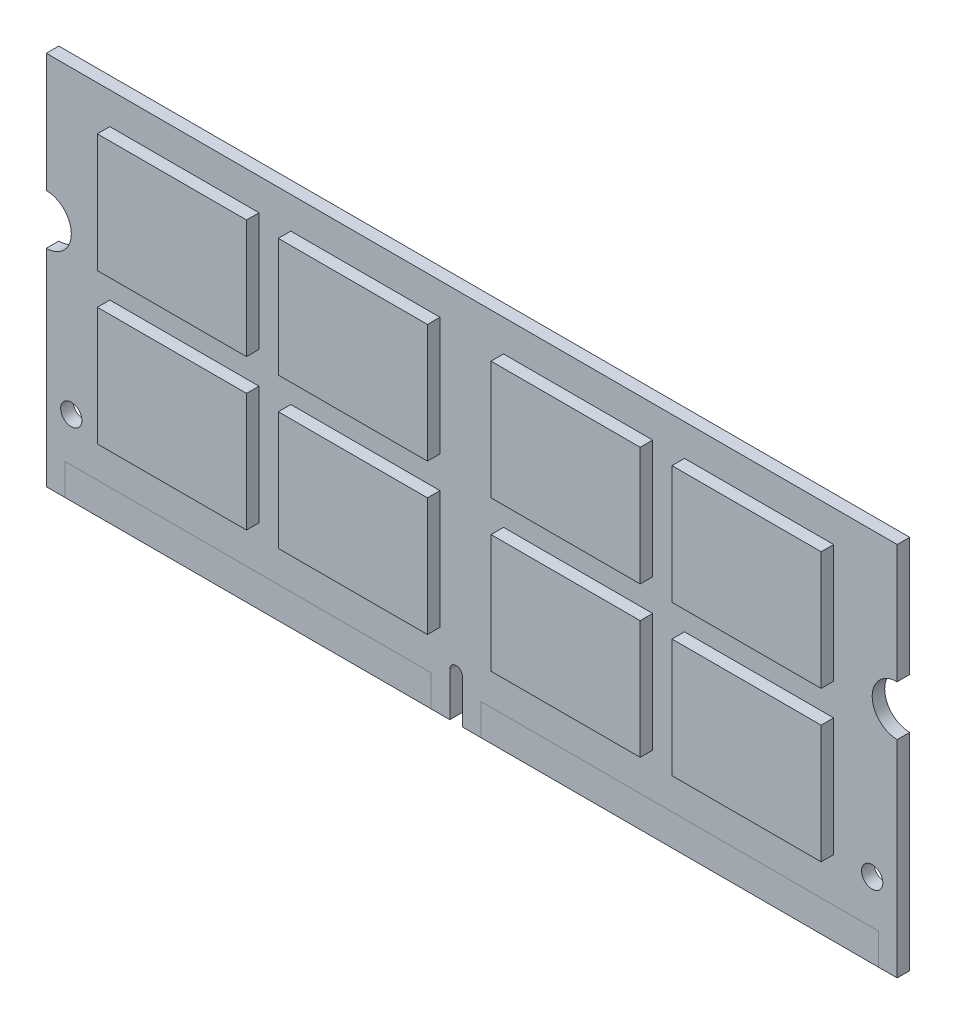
ISO-10303-21;
HEADER;
FILE_DESCRIPTION(('STEP AP214'),'2;1');
FILE_NAME('part.step','',(''),(''),'','','');
FILE_SCHEMA(('AUTOMOTIVE_DESIGN { 1 0 10303 214 1 1 1 1 }'));
ENDSEC;
DATA;
#1=APPLICATION_CONTEXT('core data for automotive mechanical design processes');
#2=APPLICATION_PROTOCOL_DEFINITION('international standard','automotive_design',2000,#1);
#3=PRODUCT_CONTEXT('',#1,'mechanical');
#4=PRODUCT('Part','Part','',(#3));
#5=PRODUCT_RELATED_PRODUCT_CATEGORY('part','',(#4));
#6=PRODUCT_DEFINITION_FORMATION('','',#4);
#7=PRODUCT_DEFINITION_CONTEXT('part definition',#1,'design');
#8=PRODUCT_DEFINITION('design','',#6,#7);
#9=PRODUCT_DEFINITION_SHAPE('','',#8);
#10=(LENGTH_UNIT() NAMED_UNIT(*) SI_UNIT(.MILLI.,.METRE.));
#11=(NAMED_UNIT(*) PLANE_ANGLE_UNIT() SI_UNIT($,.RADIAN.));
#12=(NAMED_UNIT(*) SI_UNIT($,.STERADIAN.) SOLID_ANGLE_UNIT());
#13=UNCERTAINTY_MEASURE_WITH_UNIT(LENGTH_MEASURE(1.E-05),#10,'distance_accuracy_value','');
#14=(GEOMETRIC_REPRESENTATION_CONTEXT(3) GLOBAL_UNCERTAINTY_ASSIGNED_CONTEXT((#13)) GLOBAL_UNIT_ASSIGNED_CONTEXT((#10,
#11,#12)) REPRESENTATION_CONTEXT('',''));
#15=CARTESIAN_POINT('',(0.,0.,0.));
#16=DIRECTION('',(0.,0.,1.));
#17=DIRECTION('',(1.,0.,0.));
#18=AXIS2_PLACEMENT_3D('',#15,#16,#17);
#19=CARTESIAN_POINT('',(-34.,-15.,-0.5));
#20=DIRECTION('',(0.,0.,1.));
#21=DIRECTION('',(1.,0.,0.));
#22=AXIS2_PLACEMENT_3D('',#19,#20,#21);
#23=PLANE('',#22);
#24=DIRECTION('',(0.,1.,0.));
#25=VECTOR('',#24,1.);
#26=CARTESIAN_POINT('',(28.92,-15.,-0.5));
#27=LINE('',#26,#25);
#28=CARTESIAN_POINT('',(28.92,3.,-0.5));
#29=VERTEX_POINT('',#28);
#30=CARTESIAN_POINT('',(28.92,12.46,-0.5));
#31=VERTEX_POINT('',#30);
#32=EDGE_CURVE('E796',#29,#31,#27,.T.);
#33=ORIENTED_EDGE('',*,*,#32,.T.);
#34=DIRECTION('',(-1.,0.,0.));
#35=VECTOR('',#34,1.);
#36=CARTESIAN_POINT('',(-34.,12.46,-0.5));
#37=LINE('',#36,#35);
#38=CARTESIAN_POINT('',(17.,12.46,-0.5));
#39=VERTEX_POINT('',#38);
#40=EDGE_CURVE('E799',#31,#39,#37,.T.);
#41=ORIENTED_EDGE('',*,*,#40,.T.);
#42=DIRECTION('',(0.,-1.,0.));
#43=VECTOR('',#42,1.);
#44=CARTESIAN_POINT('',(17.,-15.,-0.5));
#45=LINE('',#44,#43);
#46=CARTESIAN_POINT('',(17.,3.,-0.5));
#47=VERTEX_POINT('',#46);
#48=EDGE_CURVE('E790',#39,#47,#45,.T.);
#49=ORIENTED_EDGE('',*,*,#48,.T.);
#50=DIRECTION('',(1.,0.,0.));
#51=VECTOR('',#50,1.);
#52=CARTESIAN_POINT('',(-34.,3.,-0.5));
#53=LINE('',#52,#51);
#54=EDGE_CURVE('E793',#47,#29,#53,.T.);
#55=ORIENTED_EDGE('',*,*,#54,.T.);
#56=EDGE_LOOP('',(#33,#41,#49,#55));
#57=FACE_BOUND('',#56,.T.);
#58=DIRECTION('',(0.,1.,0.));
#59=VECTOR('',#58,1.);
#60=CARTESIAN_POINT('',(14.46,-15.,-0.5));
#61=LINE('',#60,#59);
#62=CARTESIAN_POINT('',(14.46,3.,-0.5));
#63=VERTEX_POINT('',#62);
#64=CARTESIAN_POINT('',(14.46,12.46,-0.5));
#65=VERTEX_POINT('',#64);
#66=EDGE_CURVE('E843',#63,#65,#61,.T.);
#67=ORIENTED_EDGE('',*,*,#66,.T.);
#68=DIRECTION('',(-1.,0.,0.));
#69=VECTOR('',#68,1.);
#70=CARTESIAN_POINT('',(-34.,12.46,-0.5));
#71=LINE('',#70,#69);
#72=CARTESIAN_POINT('',(2.54,12.46,-0.5));
#73=VERTEX_POINT('',#72);
#74=EDGE_CURVE('E846',#65,#73,#71,.T.);
#75=ORIENTED_EDGE('',*,*,#74,.T.);
#76=DIRECTION('',(0.,-1.,0.));
#77=VECTOR('',#76,1.);
#78=CARTESIAN_POINT('',(2.54000000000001,-15.,-0.5));
#79=LINE('',#78,#77);
#80=CARTESIAN_POINT('',(2.54000000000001,3.,-0.5));
#81=VERTEX_POINT('',#80);
#82=EDGE_CURVE('E837',#73,#81,#79,.T.);
#83=ORIENTED_EDGE('',*,*,#82,.T.);
#84=DIRECTION('',(1.,0.,0.));
#85=VECTOR('',#84,1.);
#86=CARTESIAN_POINT('',(-34.,2.99999999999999,-0.5));
#87=LINE('',#86,#85);
#88=EDGE_CURVE('E840',#81,#63,#87,.T.);
#89=ORIENTED_EDGE('',*,*,#88,.T.);
#90=EDGE_LOOP('',(#67,#75,#83,#89));
#91=FACE_BOUND('',#90,.T.);
#92=DIRECTION('',(0.,1.,0.));
#93=VECTOR('',#92,1.);
#94=CARTESIAN_POINT('',(28.92,-15.,-0.5));
#95=LINE('',#94,#93);
#96=CARTESIAN_POINT('',(28.92,-9.,-0.5));
#97=VERTEX_POINT('',#96);
#98=CARTESIAN_POINT('',(28.92,0.459999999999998,-0.5));
#99=VERTEX_POINT('',#98);
#100=EDGE_CURVE('E890',#97,#99,#95,.T.);
#101=ORIENTED_EDGE('',*,*,#100,.T.);
#102=DIRECTION('',(-1.,0.,0.));
#103=VECTOR('',#102,1.);
#104=CARTESIAN_POINT('',(-34.,0.459999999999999,-0.5));
#105=LINE('',#104,#103);
#106=CARTESIAN_POINT('',(17.,0.459999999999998,-0.5));
#107=VERTEX_POINT('',#106);
#108=EDGE_CURVE('E893',#99,#107,#105,.T.);
#109=ORIENTED_EDGE('',*,*,#108,.T.);
#110=DIRECTION('',(0.,-1.,0.));
#111=VECTOR('',#110,1.);
#112=CARTESIAN_POINT('',(17.,-15.,-0.5));
#113=LINE('',#112,#111);
#114=CARTESIAN_POINT('',(17.,-9.,-0.5));
#115=VERTEX_POINT('',#114);
#116=EDGE_CURVE('E884',#107,#115,#113,.T.);
#117=ORIENTED_EDGE('',*,*,#116,.T.);
#118=DIRECTION('',(1.,0.,0.));
#119=VECTOR('',#118,1.);
#120=CARTESIAN_POINT('',(-34.,-9.,-0.5));
#121=LINE('',#120,#119);
#122=EDGE_CURVE('E887',#115,#97,#121,.T.);
#123=ORIENTED_EDGE('',*,*,#122,.T.);
#124=EDGE_LOOP('',(#101,#109,#117,#123));
#125=FACE_BOUND('',#124,.T.);
#126=DIRECTION('',(0.,1.,0.));
#127=VECTOR('',#126,1.);
#128=CARTESIAN_POINT('',(14.46,-15.,-0.5));
#129=LINE('',#128,#127);
#130=CARTESIAN_POINT('',(14.46,-9.,-0.5));
#131=VERTEX_POINT('',#130);
#132=CARTESIAN_POINT('',(14.46,0.459999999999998,-0.5));
#133=VERTEX_POINT('',#132);
#134=EDGE_CURVE('E937',#131,#133,#129,.T.);
#135=ORIENTED_EDGE('',*,*,#134,.T.);
#136=DIRECTION('',(-1.,0.,0.));
#137=VECTOR('',#136,1.);
#138=CARTESIAN_POINT('',(-34.,0.459999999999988,-0.5));
#139=LINE('',#138,#137);
#140=CARTESIAN_POINT('',(2.54,0.459999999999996,-0.5));
#141=VERTEX_POINT('',#140);
#142=EDGE_CURVE('E940',#133,#141,#139,.T.);
#143=ORIENTED_EDGE('',*,*,#142,.T.);
#144=DIRECTION('',(0.,-1.,0.));
#145=VECTOR('',#144,1.);
#146=CARTESIAN_POINT('',(2.53999999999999,-15.,-0.5));
#147=LINE('',#146,#145);
#148=CARTESIAN_POINT('',(2.54,-9.,-0.5));
#149=VERTEX_POINT('',#148);
#150=EDGE_CURVE('E931',#141,#149,#147,.T.);
#151=ORIENTED_EDGE('',*,*,#150,.T.);
#152=DIRECTION('',(1.,0.,0.));
#153=VECTOR('',#152,1.);
#154=CARTESIAN_POINT('',(-34.,-9.,-0.5));
#155=LINE('',#154,#153);
#156=EDGE_CURVE('E934',#149,#131,#155,.T.);
#157=ORIENTED_EDGE('',*,*,#156,.T.);
#158=EDGE_LOOP('',(#135,#143,#151,#157));
#159=FACE_BOUND('',#158,.T.);
#160=DIRECTION('',(-1.,0.,0.));
#161=VECTOR('',#160,1.);
#162=CARTESIAN_POINT('',(-34.,0.460000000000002,-0.5));
#163=LINE('',#162,#161);
#164=CARTESIAN_POINT('',(-2.54,0.459999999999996,-0.5));
#165=VERTEX_POINT('',#164);
#166=CARTESIAN_POINT('',(-14.46,0.459999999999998,-0.5));
#167=VERTEX_POINT('',#166);
#168=EDGE_CURVE('E984',#165,#167,#163,.T.);
#169=ORIENTED_EDGE('',*,*,#168,.T.);
#170=DIRECTION('',(0.,-1.,0.));
#171=VECTOR('',#170,1.);
#172=CARTESIAN_POINT('',(-14.46,-15.,-0.5));
#173=LINE('',#172,#171);
#174=CARTESIAN_POINT('',(-14.46,-9.,-0.5));
#175=VERTEX_POINT('',#174);
#176=EDGE_CURVE('E987',#167,#175,#173,.T.);
#177=ORIENTED_EDGE('',*,*,#176,.T.);
#178=DIRECTION('',(1.,0.,0.));
#179=VECTOR('',#178,1.);
#180=CARTESIAN_POINT('',(-34.,-9.,-0.5));
#181=LINE('',#180,#179);
#182=CARTESIAN_POINT('',(-2.54,-9.,-0.5));
#183=VERTEX_POINT('',#182);
#184=EDGE_CURVE('E978',#175,#183,#181,.T.);
#185=ORIENTED_EDGE('',*,*,#184,.T.);
#186=DIRECTION('',(0.,1.,0.));
#187=VECTOR('',#186,1.);
#188=CARTESIAN_POINT('',(-2.53999999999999,-15.,-0.5));
#189=LINE('',#188,#187);
#190=EDGE_CURVE('E981',#183,#165,#189,.T.);
#191=ORIENTED_EDGE('',*,*,#190,.T.);
#192=EDGE_LOOP('',(#169,#177,#185,#191));
#193=FACE_BOUND('',#192,.T.);
#194=DIRECTION('',(-1.,0.,0.));
#195=VECTOR('',#194,1.);
#196=CARTESIAN_POINT('',(-34.,0.459999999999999,-0.5));
#197=LINE('',#196,#195);
#198=CARTESIAN_POINT('',(-17.,0.459999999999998,-0.5));
#199=VERTEX_POINT('',#198);
#200=CARTESIAN_POINT('',(-28.92,0.459999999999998,-0.5));
#201=VERTEX_POINT('',#200);
#202=EDGE_CURVE('E1031',#199,#201,#197,.T.);
#203=ORIENTED_EDGE('',*,*,#202,.T.);
#204=DIRECTION('',(0.,-1.,0.));
#205=VECTOR('',#204,1.);
#206=CARTESIAN_POINT('',(-28.92,-15.,-0.5));
#207=LINE('',#206,#205);
#208=CARTESIAN_POINT('',(-28.92,-9.,-0.5));
#209=VERTEX_POINT('',#208);
#210=EDGE_CURVE('E1034',#201,#209,#207,.T.);
#211=ORIENTED_EDGE('',*,*,#210,.T.);
#212=DIRECTION('',(1.,0.,0.));
#213=VECTOR('',#212,1.);
#214=CARTESIAN_POINT('',(-34.,-9.,-0.5));
#215=LINE('',#214,#213);
#216=CARTESIAN_POINT('',(-17.,-9.,-0.5));
#217=VERTEX_POINT('',#216);
#218=EDGE_CURVE('E1025',#209,#217,#215,.T.);
#219=ORIENTED_EDGE('',*,*,#218,.T.);
#220=DIRECTION('',(0.,1.,0.));
#221=VECTOR('',#220,1.);
#222=CARTESIAN_POINT('',(-17.,-15.,-0.5));
#223=LINE('',#222,#221);
#224=EDGE_CURVE('E1028',#217,#199,#223,.T.);
#225=ORIENTED_EDGE('',*,*,#224,.T.);
#226=EDGE_LOOP('',(#203,#211,#219,#225));
#227=FACE_BOUND('',#226,.T.);
#228=DIRECTION('',(-1.,0.,0.));
#229=VECTOR('',#228,1.);
#230=CARTESIAN_POINT('',(-34.,12.46,-0.5));
#231=LINE('',#230,#229);
#232=CARTESIAN_POINT('',(-2.54,12.46,-0.5));
#233=VERTEX_POINT('',#232);
#234=CARTESIAN_POINT('',(-14.46,12.46,-0.5));
#235=VERTEX_POINT('',#234);
#236=EDGE_CURVE('E1078',#233,#235,#231,.T.);
#237=ORIENTED_EDGE('',*,*,#236,.T.);
#238=DIRECTION('',(0.,-1.,0.));
#239=VECTOR('',#238,1.);
#240=CARTESIAN_POINT('',(-14.46,-15.,-0.5));
#241=LINE('',#240,#239);
#242=CARTESIAN_POINT('',(-14.46,3.,-0.5));
#243=VERTEX_POINT('',#242);
#244=EDGE_CURVE('E1081',#235,#243,#241,.T.);
#245=ORIENTED_EDGE('',*,*,#244,.T.);
#246=DIRECTION('',(1.,0.,0.));
#247=VECTOR('',#246,1.);
#248=CARTESIAN_POINT('',(-34.,3.,-0.5));
#249=LINE('',#248,#247);
#250=CARTESIAN_POINT('',(-2.54000000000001,3.,-0.5));
#251=VERTEX_POINT('',#250);
#252=EDGE_CURVE('E1072',#243,#251,#249,.T.);
#253=ORIENTED_EDGE('',*,*,#252,.T.);
#254=DIRECTION('',(0.,1.,0.));
#255=VECTOR('',#254,1.);
#256=CARTESIAN_POINT('',(-2.54000000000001,-15.,-0.5));
#257=LINE('',#256,#255);
#258=EDGE_CURVE('E1075',#251,#233,#257,.T.);
#259=ORIENTED_EDGE('',*,*,#258,.T.);
#260=EDGE_LOOP('',(#237,#245,#253,#259));
#261=FACE_BOUND('',#260,.T.);
#262=DIRECTION('',(-1.,0.,0.));
#263=VECTOR('',#262,1.);
#264=CARTESIAN_POINT('',(-34.,12.46,-0.5));
#265=LINE('',#264,#263);
#266=CARTESIAN_POINT('',(-17.,12.46,-0.5));
#267=VERTEX_POINT('',#266);
#268=CARTESIAN_POINT('',(-28.92,12.46,-0.5));
#269=VERTEX_POINT('',#268);
#270=EDGE_CURVE('E1125',#267,#269,#265,.T.);
#271=ORIENTED_EDGE('',*,*,#270,.T.);
#272=DIRECTION('',(0.,-1.,0.));
#273=VECTOR('',#272,1.);
#274=CARTESIAN_POINT('',(-28.92,-15.,-0.5));
#275=LINE('',#274,#273);
#276=CARTESIAN_POINT('',(-28.92,3.,-0.5));
#277=VERTEX_POINT('',#276);
#278=EDGE_CURVE('E1128',#269,#277,#275,.T.);
#279=ORIENTED_EDGE('',*,*,#278,.T.);
#280=DIRECTION('',(1.,0.,0.));
#281=VECTOR('',#280,1.);
#282=CARTESIAN_POINT('',(-34.,3.,-0.5));
#283=LINE('',#282,#281);
#284=CARTESIAN_POINT('',(-17.,3.,-0.5));
#285=VERTEX_POINT('',#284);
#286=EDGE_CURVE('E1119',#277,#285,#283,.T.);
#287=ORIENTED_EDGE('',*,*,#286,.T.);
#288=DIRECTION('',(0.,1.,0.));
#289=VECTOR('',#288,1.);
#290=CARTESIAN_POINT('',(-17.,-15.,-0.5));
#291=LINE('',#290,#289);
#292=EDGE_CURVE('E1122',#285,#267,#291,.T.);
#293=ORIENTED_EDGE('',*,*,#292,.T.);
#294=EDGE_LOOP('',(#271,#279,#287,#293));
#295=FACE_BOUND('',#294,.T.);
#296=CARTESIAN_POINT('',(32.,-9.,-0.5));
#297=DIRECTION('',(0.,0.,1.));
#298=DIRECTION('',(1.,0.,0.));
#299=AXIS2_PLACEMENT_3D('',#296,#297,#298);
#300=CIRCLE('',#299,0.849999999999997);
#301=CARTESIAN_POINT('',(32.85,-9.,-0.5));
#302=VERTEX_POINT('',#301);
#303=EDGE_CURVE('E1161',#302,#302,#300,.T.);
#304=ORIENTED_EDGE('',*,*,#303,.T.);
#305=EDGE_LOOP('',(#304));
#306=FACE_BOUND('',#305,.T.);
#307=CARTESIAN_POINT('',(-32.,-9.,-0.5));
#308=DIRECTION('',(0.,0.,1.));
#309=DIRECTION('',(1.,0.,0.));
#310=AXIS2_PLACEMENT_3D('',#307,#308,#309);
#311=CIRCLE('',#310,0.85);
#312=CARTESIAN_POINT('',(-31.15,-9.,-0.5));
#313=VERTEX_POINT('',#312);
#314=EDGE_CURVE('E1167',#313,#313,#311,.T.);
#315=ORIENTED_EDGE('',*,*,#314,.T.);
#316=EDGE_LOOP('',(#315));
#317=FACE_BOUND('',#316,.T.);
#318=DIRECTION('',(0.,-1.,0.));
#319=VECTOR('',#318,1.);
#320=CARTESIAN_POINT('',(-34.,15.,-0.5));
#321=LINE('',#320,#319);
#322=CARTESIAN_POINT('',(-34.,15.,-0.500000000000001));
#323=VERTEX_POINT('',#322);
#324=CARTESIAN_POINT('',(-34.,5.5,-0.5));
#325=VERTEX_POINT('',#324);
#326=EDGE_CURVE('E610',#323,#325,#321,.T.);
#327=ORIENTED_EDGE('',*,*,#326,.F.);
#328=DIRECTION('',(1.,0.,0.));
#329=VECTOR('',#328,1.);
#330=CARTESIAN_POINT('',(-34.,15.,-0.5));
#331=LINE('',#330,#329);
#332=CARTESIAN_POINT('',(34.,15.,-0.500000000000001));
#333=VERTEX_POINT('',#332);
#334=EDGE_CURVE('E572',#323,#333,#331,.T.);
#335=ORIENTED_EDGE('',*,*,#334,.T.);
#336=DIRECTION('',(0.,1.,0.));
#337=VECTOR('',#336,1.);
#338=CARTESIAN_POINT('',(34.,15.,-0.5));
#339=LINE('',#338,#337);
#340=CARTESIAN_POINT('',(34.,5.50000000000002,-0.5));
#341=VERTEX_POINT('',#340);
#342=EDGE_CURVE('E617',#341,#333,#339,.T.);
#343=ORIENTED_EDGE('',*,*,#342,.F.);
#344=CARTESIAN_POINT('',(34.,3.5,-0.5));
#345=DIRECTION('',(0.,0.,1.));
#346=DIRECTION('',(1.,0.,0.));
#347=AXIS2_PLACEMENT_3D('',#344,#345,#346);
#348=CIRCLE('',#347,2.00000000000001);
#349=CARTESIAN_POINT('',(34.,1.5,-0.5));
#350=VERTEX_POINT('',#349);
#351=EDGE_CURVE('E1171',#341,#350,#348,.T.);
#352=ORIENTED_EDGE('',*,*,#351,.T.);
#353=CARTESIAN_POINT('',(34.,-15.,-0.5));
#354=VERTEX_POINT('',#353);
#355=EDGE_CURVE('E599',#354,#350,#339,.T.);
#356=ORIENTED_EDGE('',*,*,#355,.F.);
#357=DIRECTION('',(1.,0.,0.));
#358=VECTOR('',#357,1.);
#359=CARTESIAN_POINT('',(-34.,-15.,-0.5));
#360=LINE('',#359,#358);
#361=CARTESIAN_POINT('',(32.5,-15.,-0.5));
#362=VERTEX_POINT('',#361);
#363=EDGE_CURVE('E612',#362,#354,#360,.T.);
#364=ORIENTED_EDGE('',*,*,#363,.F.);
#365=DIRECTION('',(0.,-1.,0.));
#366=VECTOR('',#365,1.);
#367=CARTESIAN_POINT('',(32.5,-15.,-0.5));
#368=LINE('',#367,#366);
#369=CARTESIAN_POINT('',(32.5,-12.5,-0.5));
#370=VERTEX_POINT('',#369);
#371=EDGE_CURVE('E662',#370,#362,#368,.T.);
#372=ORIENTED_EDGE('',*,*,#371,.F.);
#373=DIRECTION('',(1.,0.,0.));
#374=VECTOR('',#373,1.);
#375=CARTESIAN_POINT('',(-34.,-12.5,-0.5));
#376=LINE('',#375,#374);
#377=CARTESIAN_POINT('',(0.750000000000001,-12.5,-0.5));
#378=VERTEX_POINT('',#377);
#379=EDGE_CURVE('E657',#378,#370,#376,.T.);
#380=ORIENTED_EDGE('',*,*,#379,.F.);
#381=DIRECTION('',(0.,1.,0.));
#382=VECTOR('',#381,1.);
#383=CARTESIAN_POINT('',(0.750000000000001,-15.,-0.5));
#384=LINE('',#383,#382);
#385=CARTESIAN_POINT('',(0.750000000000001,-15.,-0.5));
#386=VERTEX_POINT('',#385);
#387=EDGE_CURVE('E658',#386,#378,#384,.T.);
#388=ORIENTED_EDGE('',*,*,#387,.F.);
#389=CARTESIAN_POINT('',(-0.749999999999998,-15.,-0.5));
#390=VERTEX_POINT('',#389);
#391=EDGE_CURVE('E619',#390,#386,#360,.T.);
#392=ORIENTED_EDGE('',*,*,#391,.F.);
#393=DIRECTION('',(0.,1.,0.));
#394=VECTOR('',#393,1.);
#395=CARTESIAN_POINT('',(-0.75,-11.5,-0.5));
#396=LINE('',#395,#394);
#397=CARTESIAN_POINT('',(-0.750000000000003,-11.5,-0.5));
#398=VERTEX_POINT('',#397);
#399=EDGE_CURVE('E1132',#390,#398,#396,.T.);
#400=ORIENTED_EDGE('',*,*,#399,.T.);
#401=CARTESIAN_POINT('',(-1.25,-11.5,-0.5));
#402=DIRECTION('',(0.,0.,1.));
#403=DIRECTION('',(-1.,0.,0.));
#404=AXIS2_PLACEMENT_3D('',#401,#402,#403);
#405=CIRCLE('',#404,0.5);
#406=CARTESIAN_POINT('',(-1.75,-11.5,-0.5));
#407=VERTEX_POINT('',#406);
#408=EDGE_CURVE('E1135',#398,#407,#405,.T.);
#409=ORIENTED_EDGE('',*,*,#408,.T.);
#410=DIRECTION('',(0.,-1.,0.));
#411=VECTOR('',#410,1.);
#412=CARTESIAN_POINT('',(-1.75,-15.,-0.5));
#413=LINE('',#412,#411);
#414=CARTESIAN_POINT('',(-1.75,-15.,-0.5));
#415=VERTEX_POINT('',#414);
#416=EDGE_CURVE('E1139',#407,#415,#413,.T.);
#417=ORIENTED_EDGE('',*,*,#416,.T.);
#418=CARTESIAN_POINT('',(-3.25,-15.,-0.5));
#419=VERTEX_POINT('',#418);
#420=EDGE_CURVE('E1230',#419,#415,#360,.T.);
#421=ORIENTED_EDGE('',*,*,#420,.F.);
#422=DIRECTION('',(0.,-1.,0.));
#423=VECTOR('',#422,1.);
#424=CARTESIAN_POINT('',(-3.25,-15.,-0.5));
#425=LINE('',#424,#423);
#426=CARTESIAN_POINT('',(-3.25,-12.5,-0.5));
#427=VERTEX_POINT('',#426);
#428=EDGE_CURVE('E642',#427,#419,#425,.T.);
#429=ORIENTED_EDGE('',*,*,#428,.F.);
#430=DIRECTION('',(1.,0.,0.));
#431=VECTOR('',#430,1.);
#432=CARTESIAN_POINT('',(-34.,-12.5,-0.5));
#433=LINE('',#432,#431);
#434=CARTESIAN_POINT('',(-32.5,-12.5,-0.5));
#435=VERTEX_POINT('',#434);
#436=EDGE_CURVE('E637',#435,#427,#433,.T.);
#437=ORIENTED_EDGE('',*,*,#436,.F.);
#438=DIRECTION('',(0.,1.,0.));
#439=VECTOR('',#438,1.);
#440=CARTESIAN_POINT('',(-32.5,-15.,-0.5));
#441=LINE('',#440,#439);
#442=CARTESIAN_POINT('',(-32.5,-15.,-0.5));
#443=VERTEX_POINT('',#442);
#444=EDGE_CURVE('E638',#443,#435,#441,.T.);
#445=ORIENTED_EDGE('',*,*,#444,.F.);
#446=CARTESIAN_POINT('',(-34.,-15.,-0.5));
#447=VERTEX_POINT('',#446);
#448=EDGE_CURVE('E614',#447,#443,#360,.T.);
#449=ORIENTED_EDGE('',*,*,#448,.F.);
#450=CARTESIAN_POINT('',(-34.,1.5,-0.5));
#451=VERTEX_POINT('',#450);
#452=EDGE_CURVE('E613',#451,#447,#321,.T.);
#453=ORIENTED_EDGE('',*,*,#452,.F.);
#454=CARTESIAN_POINT('',(-34.,3.5,-0.5));
#455=DIRECTION('',(0.,0.,1.));
#456=DIRECTION('',(-1.,0.,0.));
#457=AXIS2_PLACEMENT_3D('',#454,#455,#456);
#458=CIRCLE('',#457,2.);
#459=EDGE_CURVE('E1181',#451,#325,#458,.T.);
#460=ORIENTED_EDGE('',*,*,#459,.T.);
#461=EDGE_LOOP('',(#327,#335,#343,#352,#356,#364,#372,#380,#388,#392,#400,#409,#417,#421,#429,
#437,#445,#449,#453,#460));
#462=FACE_BOUND('',#461,.T.);
#463=ADVANCED_FACE('F49',(#57,#91,#125,#159,#193,#227,#261,#295,#306,#317,#462),#23,.F.);
#464=CARTESIAN_POINT('',(-34.,-15.,0.5));
#465=DIRECTION('',(0.,0.,1.));
#466=DIRECTION('',(1.,0.,0.));
#467=AXIS2_PLACEMENT_3D('',#464,#465,#466);
#468=PLANE('',#467);
#469=DIRECTION('',(1.,0.,0.));
#470=VECTOR('',#469,1.);
#471=CARTESIAN_POINT('',(-34.,15.,0.5));
#472=LINE('',#471,#470);
#473=CARTESIAN_POINT('',(-34.,15.,0.5));
#474=VERTEX_POINT('',#473);
#475=CARTESIAN_POINT('',(34.,15.,0.5));
#476=VERTEX_POINT('',#475);
#477=EDGE_CURVE('E64',#474,#476,#472,.T.);
#478=ORIENTED_EDGE('',*,*,#477,.F.);
#479=DIRECTION('',(0.,-1.,0.));
#480=VECTOR('',#479,1.);
#481=CARTESIAN_POINT('',(-34.,15.,0.5));
#482=LINE('',#481,#480);
#483=CARTESIAN_POINT('',(-34.,5.5,0.5));
#484=VERTEX_POINT('',#483);
#485=EDGE_CURVE('E583',#474,#484,#482,.T.);
#486=ORIENTED_EDGE('',*,*,#485,.T.);
#487=CARTESIAN_POINT('',(-34.,3.5,0.5));
#488=DIRECTION('',(0.,0.,1.));
#489=DIRECTION('',(-1.,0.,0.));
#490=AXIS2_PLACEMENT_3D('',#487,#488,#489);
#491=CIRCLE('',#490,2.);
#492=CARTESIAN_POINT('',(-34.,1.5,0.5));
#493=VERTEX_POINT('',#492);
#494=EDGE_CURVE('E1178',#493,#484,#491,.T.);
#495=ORIENTED_EDGE('',*,*,#494,.F.);
#496=CARTESIAN_POINT('',(-34.,-15.,0.5));
#497=VERTEX_POINT('',#496);
#498=EDGE_CURVE('E594',#493,#497,#482,.T.);
#499=ORIENTED_EDGE('',*,*,#498,.T.);
#500=DIRECTION('',(1.,0.,0.));
#501=VECTOR('',#500,1.);
#502=CARTESIAN_POINT('',(-34.,-15.,0.5));
#503=LINE('',#502,#501);
#504=CARTESIAN_POINT('',(-32.5,-15.,0.5));
#505=VERTEX_POINT('',#504);
#506=EDGE_CURVE('E598',#497,#505,#503,.T.);
#507=ORIENTED_EDGE('',*,*,#506,.T.);
#508=DIRECTION('',(0.,1.,0.));
#509=VECTOR('',#508,1.);
#510=CARTESIAN_POINT('',(-32.5,-15.,0.5));
#511=LINE('',#510,#509);
#512=CARTESIAN_POINT('',(-32.5,-12.5,0.5));
#513=VERTEX_POINT('',#512);
#514=EDGE_CURVE('E634',#505,#513,#511,.T.);
#515=ORIENTED_EDGE('',*,*,#514,.T.);
#516=DIRECTION('',(1.,0.,0.));
#517=VECTOR('',#516,1.);
#518=CARTESIAN_POINT('',(-34.,-12.5,0.5));
#519=LINE('',#518,#517);
#520=CARTESIAN_POINT('',(-3.25,-12.5,0.5));
#521=VERTEX_POINT('',#520);
#522=EDGE_CURVE('E627',#513,#521,#519,.T.);
#523=ORIENTED_EDGE('',*,*,#522,.T.);
#524=DIRECTION('',(0.,-1.,0.));
#525=VECTOR('',#524,1.);
#526=CARTESIAN_POINT('',(-3.25,-15.,0.5));
#527=LINE('',#526,#525);
#528=CARTESIAN_POINT('',(-3.25,-15.,0.5));
#529=VERTEX_POINT('',#528);
#530=EDGE_CURVE('E631',#521,#529,#527,.T.);
#531=ORIENTED_EDGE('',*,*,#530,.T.);
#532=CARTESIAN_POINT('',(-1.75,-15.,0.5));
#533=VERTEX_POINT('',#532);
#534=EDGE_CURVE('E1239',#529,#533,#503,.T.);
#535=ORIENTED_EDGE('',*,*,#534,.T.);
#536=DIRECTION('',(0.,-1.,0.));
#537=VECTOR('',#536,1.);
#538=CARTESIAN_POINT('',(-1.75,-15.,0.5));
#539=LINE('',#538,#537);
#540=CARTESIAN_POINT('',(-1.75,-11.5,0.5));
#541=VERTEX_POINT('',#540);
#542=EDGE_CURVE('E1136',#541,#533,#539,.T.);
#543=ORIENTED_EDGE('',*,*,#542,.F.);
#544=CARTESIAN_POINT('',(-1.25,-11.5,0.5));
#545=DIRECTION('',(0.,0.,1.));
#546=DIRECTION('',(-1.,0.,0.));
#547=AXIS2_PLACEMENT_3D('',#544,#545,#546);
#548=CIRCLE('',#547,0.5);
#549=CARTESIAN_POINT('',(-0.75,-11.5,0.5));
#550=VERTEX_POINT('',#549);
#551=EDGE_CURVE('E1145',#550,#541,#548,.T.);
#552=ORIENTED_EDGE('',*,*,#551,.F.);
#553=DIRECTION('',(0.,1.,0.));
#554=VECTOR('',#553,1.);
#555=CARTESIAN_POINT('',(-0.75,-11.5,0.5));
#556=LINE('',#555,#554);
#557=CARTESIAN_POINT('',(-0.749999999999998,-15.,0.5));
#558=VERTEX_POINT('',#557);
#559=EDGE_CURVE('E1131',#558,#550,#556,.T.);
#560=ORIENTED_EDGE('',*,*,#559,.F.);
#561=CARTESIAN_POINT('',(0.750000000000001,-15.,0.5));
#562=VERTEX_POINT('',#561);
#563=EDGE_CURVE('E605',#558,#562,#503,.T.);
#564=ORIENTED_EDGE('',*,*,#563,.T.);
#565=DIRECTION('',(0.,1.,0.));
#566=VECTOR('',#565,1.);
#567=CARTESIAN_POINT('',(0.750000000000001,-15.,0.5));
#568=LINE('',#567,#566);
#569=CARTESIAN_POINT('',(0.750000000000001,-12.5,0.5));
#570=VERTEX_POINT('',#569);
#571=EDGE_CURVE('E654',#562,#570,#568,.T.);
#572=ORIENTED_EDGE('',*,*,#571,.T.);
#573=DIRECTION('',(1.,0.,0.));
#574=VECTOR('',#573,1.);
#575=CARTESIAN_POINT('',(-34.,-12.5,0.5));
#576=LINE('',#575,#574);
#577=CARTESIAN_POINT('',(32.5,-12.5,0.5));
#578=VERTEX_POINT('',#577);
#579=EDGE_CURVE('E641',#570,#578,#576,.T.);
#580=ORIENTED_EDGE('',*,*,#579,.T.);
#581=DIRECTION('',(0.,-1.,0.));
#582=VECTOR('',#581,1.);
#583=CARTESIAN_POINT('',(32.5,-15.,0.5));
#584=LINE('',#583,#582);
#585=CARTESIAN_POINT('',(32.5,-15.,0.5));
#586=VERTEX_POINT('',#585);
#587=EDGE_CURVE('E651',#578,#586,#584,.T.);
#588=ORIENTED_EDGE('',*,*,#587,.T.);
#589=CARTESIAN_POINT('',(34.,-15.,0.5));
#590=VERTEX_POINT('',#589);
#591=EDGE_CURVE('E593',#586,#590,#503,.T.);
#592=ORIENTED_EDGE('',*,*,#591,.T.);
#593=DIRECTION('',(0.,1.,0.));
#594=VECTOR('',#593,1.);
#595=CARTESIAN_POINT('',(34.,15.,0.5));
#596=LINE('',#595,#594);
#597=CARTESIAN_POINT('',(34.,1.5,0.5));
#598=VERTEX_POINT('',#597);
#599=EDGE_CURVE('E606',#590,#598,#596,.T.);
#600=ORIENTED_EDGE('',*,*,#599,.T.);
#601=CARTESIAN_POINT('',(34.,3.5,0.5));
#602=DIRECTION('',(0.,0.,1.));
#603=DIRECTION('',(1.,0.,0.));
#604=AXIS2_PLACEMENT_3D('',#601,#602,#603);
#605=CIRCLE('',#604,2.00000000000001);
#606=CARTESIAN_POINT('',(34.,5.50000000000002,0.5));
#607=VERTEX_POINT('',#606);
#608=EDGE_CURVE('E1170',#607,#598,#605,.T.);
#609=ORIENTED_EDGE('',*,*,#608,.F.);
#610=EDGE_CURVE('E587',#607,#476,#596,.T.);
#611=ORIENTED_EDGE('',*,*,#610,.T.);
#612=EDGE_LOOP('',(#478,#486,#495,#499,#507,#515,#523,#531,#535,#543,#552,#560,#564,#572,#580,
#588,#592,#600,#609,#611));
#613=FACE_BOUND('',#612,.T.);
#614=DIRECTION('',(-1.,0.,0.));
#615=VECTOR('',#614,1.);
#616=CARTESIAN_POINT('',(-34.,12.46,0.5));
#617=LINE('',#616,#615);
#618=CARTESIAN_POINT('',(28.92,12.46,0.5));
#619=VERTEX_POINT('',#618);
#620=CARTESIAN_POINT('',(17.,12.46,0.5));
#621=VERTEX_POINT('',#620);
#622=EDGE_CURVE('E12',#619,#621,#617,.T.);
#623=ORIENTED_EDGE('',*,*,#622,.F.);
#624=DIRECTION('',(0.,1.,0.));
#625=VECTOR('',#624,1.);
#626=CARTESIAN_POINT('',(28.92,-15.,0.5));
#627=LINE('',#626,#625);
#628=CARTESIAN_POINT('',(28.92,3.,0.5));
#629=VERTEX_POINT('',#628);
#630=EDGE_CURVE('E57',#629,#619,#627,.T.);
#631=ORIENTED_EDGE('',*,*,#630,.F.);
#632=DIRECTION('',(1.,0.,0.));
#633=VECTOR('',#632,1.);
#634=CARTESIAN_POINT('',(-34.,3.,0.5));
#635=LINE('',#634,#633);
#636=CARTESIAN_POINT('',(17.,3.,0.5));
#637=VERTEX_POINT('',#636);
#638=EDGE_CURVE('E754',#637,#629,#635,.T.);
#639=ORIENTED_EDGE('',*,*,#638,.F.);
#640=DIRECTION('',(0.,-1.,0.));
#641=VECTOR('',#640,1.);
#642=CARTESIAN_POINT('',(17.,-15.,0.5));
#643=LINE('',#642,#641);
#644=EDGE_CURVE('E751',#621,#637,#643,.T.);
#645=ORIENTED_EDGE('',*,*,#644,.F.);
#646=EDGE_LOOP('',(#623,#631,#639,#645));
#647=FACE_BOUND('',#646,.T.);
#648=DIRECTION('',(-1.,0.,0.));
#649=VECTOR('',#648,1.);
#650=CARTESIAN_POINT('',(-34.,12.46,0.5));
#651=LINE('',#650,#649);
#652=CARTESIAN_POINT('',(14.46,12.46,0.5));
#653=VERTEX_POINT('',#652);
#654=CARTESIAN_POINT('',(2.54,12.46,0.5));
#655=VERTEX_POINT('',#654);
#656=EDGE_CURVE('E748',#653,#655,#651,.T.);
#657=ORIENTED_EDGE('',*,*,#656,.F.);
#658=DIRECTION('',(0.,1.,0.));
#659=VECTOR('',#658,1.);
#660=CARTESIAN_POINT('',(14.46,-15.,0.5));
#661=LINE('',#660,#659);
#662=CARTESIAN_POINT('',(14.46,3.,0.5));
#663=VERTEX_POINT('',#662);
#664=EDGE_CURVE('E745',#663,#653,#661,.T.);
#665=ORIENTED_EDGE('',*,*,#664,.F.);
#666=DIRECTION('',(1.,0.,0.));
#667=VECTOR('',#666,1.);
#668=CARTESIAN_POINT('',(-34.,2.99999999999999,0.5));
#669=LINE('',#668,#667);
#670=CARTESIAN_POINT('',(2.54,3.,0.5));
#671=VERTEX_POINT('',#670);
#672=EDGE_CURVE('E742',#671,#663,#669,.T.);
#673=ORIENTED_EDGE('',*,*,#672,.F.);
#674=DIRECTION('',(0.,-1.,0.));
#675=VECTOR('',#674,1.);
#676=CARTESIAN_POINT('',(2.54000000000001,-15.,0.5));
#677=LINE('',#676,#675);
#678=EDGE_CURVE('E739',#655,#671,#677,.T.);
#679=ORIENTED_EDGE('',*,*,#678,.F.);
#680=EDGE_LOOP('',(#657,#665,#673,#679));
#681=FACE_BOUND('',#680,.T.);
#682=DIRECTION('',(-1.,0.,0.));
#683=VECTOR('',#682,1.);
#684=CARTESIAN_POINT('',(-34.,0.459999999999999,0.5));
#685=LINE('',#684,#683);
#686=CARTESIAN_POINT('',(28.92,0.459999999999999,0.5));
#687=VERTEX_POINT('',#686);
#688=CARTESIAN_POINT('',(17.,0.459999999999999,0.5));
#689=VERTEX_POINT('',#688);
#690=EDGE_CURVE('E736',#687,#689,#685,.T.);
#691=ORIENTED_EDGE('',*,*,#690,.F.);
#692=DIRECTION('',(0.,1.,0.));
#693=VECTOR('',#692,1.);
#694=CARTESIAN_POINT('',(28.92,-15.,0.5));
#695=LINE('',#694,#693);
#696=CARTESIAN_POINT('',(28.92,-9.,0.5));
#697=VERTEX_POINT('',#696);
#698=EDGE_CURVE('E733',#697,#687,#695,.T.);
#699=ORIENTED_EDGE('',*,*,#698,.F.);
#700=DIRECTION('',(1.,0.,0.));
#701=VECTOR('',#700,1.);
#702=CARTESIAN_POINT('',(-34.,-9.,0.5));
#703=LINE('',#702,#701);
#704=CARTESIAN_POINT('',(17.,-9.,0.5));
#705=VERTEX_POINT('',#704);
#706=EDGE_CURVE('E730',#705,#697,#703,.T.);
#707=ORIENTED_EDGE('',*,*,#706,.F.);
#708=DIRECTION('',(0.,-1.,0.));
#709=VECTOR('',#708,1.);
#710=CARTESIAN_POINT('',(17.,-15.,0.5));
#711=LINE('',#710,#709);
#712=EDGE_CURVE('E727',#689,#705,#711,.T.);
#713=ORIENTED_EDGE('',*,*,#712,.F.);
#714=EDGE_LOOP('',(#691,#699,#707,#713));
#715=FACE_BOUND('',#714,.T.);
#716=DIRECTION('',(-1.,0.,0.));
#717=VECTOR('',#716,1.);
#718=CARTESIAN_POINT('',(-34.,0.459999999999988,0.5));
#719=LINE('',#718,#717);
#720=CARTESIAN_POINT('',(14.46,0.459999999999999,0.5));
#721=VERTEX_POINT('',#720);
#722=CARTESIAN_POINT('',(2.54,0.459999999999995,0.5));
#723=VERTEX_POINT('',#722);
#724=EDGE_CURVE('E724',#721,#723,#719,.T.);
#725=ORIENTED_EDGE('',*,*,#724,.F.);
#726=DIRECTION('',(0.,1.,0.));
#727=VECTOR('',#726,1.);
#728=CARTESIAN_POINT('',(14.46,-15.,0.5));
#729=LINE('',#728,#727);
#730=CARTESIAN_POINT('',(14.46,-9.,0.5));
#731=VERTEX_POINT('',#730);
#732=EDGE_CURVE('E721',#731,#721,#729,.T.);
#733=ORIENTED_EDGE('',*,*,#732,.F.);
#734=DIRECTION('',(1.,0.,0.));
#735=VECTOR('',#734,1.);
#736=CARTESIAN_POINT('',(-34.,-9.,0.5));
#737=LINE('',#736,#735);
#738=CARTESIAN_POINT('',(2.54,-9.,0.5));
#739=VERTEX_POINT('',#738);
#740=EDGE_CURVE('E718',#739,#731,#737,.T.);
#741=ORIENTED_EDGE('',*,*,#740,.F.);
#742=DIRECTION('',(0.,-1.,0.));
#743=VECTOR('',#742,1.);
#744=CARTESIAN_POINT('',(2.53999999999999,-15.,0.5));
#745=LINE('',#744,#743);
#746=EDGE_CURVE('E715',#723,#739,#745,.T.);
#747=ORIENTED_EDGE('',*,*,#746,.F.);
#748=EDGE_LOOP('',(#725,#733,#741,#747));
#749=FACE_BOUND('',#748,.T.);
#750=DIRECTION('',(0.,-1.,0.));
#751=VECTOR('',#750,1.);
#752=CARTESIAN_POINT('',(-14.46,-15.,0.5));
#753=LINE('',#752,#751);
#754=CARTESIAN_POINT('',(-14.46,0.459999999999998,0.5));
#755=VERTEX_POINT('',#754);
#756=CARTESIAN_POINT('',(-14.46,-9.,0.5));
#757=VERTEX_POINT('',#756);
#758=EDGE_CURVE('E712',#755,#757,#753,.T.);
#759=ORIENTED_EDGE('',*,*,#758,.F.);
#760=DIRECTION('',(-1.,0.,0.));
#761=VECTOR('',#760,1.);
#762=CARTESIAN_POINT('',(-34.,0.460000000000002,0.5));
#763=LINE('',#762,#761);
#764=CARTESIAN_POINT('',(-2.54,0.459999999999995,0.5));
#765=VERTEX_POINT('',#764);
#766=EDGE_CURVE('E709',#765,#755,#763,.T.);
#767=ORIENTED_EDGE('',*,*,#766,.F.);
#768=DIRECTION('',(0.,1.,0.));
#769=VECTOR('',#768,1.);
#770=CARTESIAN_POINT('',(-2.53999999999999,-15.,0.5));
#771=LINE('',#770,#769);
#772=CARTESIAN_POINT('',(-2.54,-9.,0.5));
#773=VERTEX_POINT('',#772);
#774=EDGE_CURVE('E706',#773,#765,#771,.T.);
#775=ORIENTED_EDGE('',*,*,#774,.F.);
#776=DIRECTION('',(1.,0.,0.));
#777=VECTOR('',#776,1.);
#778=CARTESIAN_POINT('',(-34.,-9.,0.5));
#779=LINE('',#778,#777);
#780=EDGE_CURVE('E703',#757,#773,#779,.T.);
#781=ORIENTED_EDGE('',*,*,#780,.F.);
#782=EDGE_LOOP('',(#759,#767,#775,#781));
#783=FACE_BOUND('',#782,.T.);
#784=DIRECTION('',(0.,-1.,0.));
#785=VECTOR('',#784,1.);
#786=CARTESIAN_POINT('',(-28.92,-15.,0.5));
#787=LINE('',#786,#785);
#788=CARTESIAN_POINT('',(-28.92,0.459999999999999,0.5));
#789=VERTEX_POINT('',#788);
#790=CARTESIAN_POINT('',(-28.92,-9.,0.5));
#791=VERTEX_POINT('',#790);
#792=EDGE_CURVE('E700',#789,#791,#787,.T.);
#793=ORIENTED_EDGE('',*,*,#792,.F.);
#794=DIRECTION('',(-1.,0.,0.));
#795=VECTOR('',#794,1.);
#796=CARTESIAN_POINT('',(-34.,0.459999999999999,0.5));
#797=LINE('',#796,#795);
#798=CARTESIAN_POINT('',(-17.,0.459999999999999,0.5));
#799=VERTEX_POINT('',#798);
#800=EDGE_CURVE('E697',#799,#789,#797,.T.);
#801=ORIENTED_EDGE('',*,*,#800,.F.);
#802=DIRECTION('',(0.,1.,0.));
#803=VECTOR('',#802,1.);
#804=CARTESIAN_POINT('',(-17.,-15.,0.5));
#805=LINE('',#804,#803);
#806=CARTESIAN_POINT('',(-17.,-9.,0.5));
#807=VERTEX_POINT('',#806);
#808=EDGE_CURVE('E694',#807,#799,#805,.T.);
#809=ORIENTED_EDGE('',*,*,#808,.F.);
#810=DIRECTION('',(1.,0.,0.));
#811=VECTOR('',#810,1.);
#812=CARTESIAN_POINT('',(-34.,-9.,0.5));
#813=LINE('',#812,#811);
#814=EDGE_CURVE('E691',#791,#807,#813,.T.);
#815=ORIENTED_EDGE('',*,*,#814,.F.);
#816=EDGE_LOOP('',(#793,#801,#809,#815));
#817=FACE_BOUND('',#816,.T.);
#818=DIRECTION('',(0.,-1.,0.));
#819=VECTOR('',#818,1.);
#820=CARTESIAN_POINT('',(-14.46,-15.,0.5));
#821=LINE('',#820,#819);
#822=CARTESIAN_POINT('',(-14.46,12.46,0.5));
#823=VERTEX_POINT('',#822);
#824=CARTESIAN_POINT('',(-14.46,3.,0.5));
#825=VERTEX_POINT('',#824);
#826=EDGE_CURVE('E688',#823,#825,#821,.T.);
#827=ORIENTED_EDGE('',*,*,#826,.F.);
#828=DIRECTION('',(-1.,0.,0.));
#829=VECTOR('',#828,1.);
#830=CARTESIAN_POINT('',(-34.,12.46,0.5));
#831=LINE('',#830,#829);
#832=CARTESIAN_POINT('',(-2.54,12.46,0.5));
#833=VERTEX_POINT('',#832);
#834=EDGE_CURVE('E685',#833,#823,#831,.T.);
#835=ORIENTED_EDGE('',*,*,#834,.F.);
#836=DIRECTION('',(0.,1.,0.));
#837=VECTOR('',#836,1.);
#838=CARTESIAN_POINT('',(-2.54000000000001,-15.,0.5));
#839=LINE('',#838,#837);
#840=CARTESIAN_POINT('',(-2.54,3.,0.5));
#841=VERTEX_POINT('',#840);
#842=EDGE_CURVE('E682',#841,#833,#839,.T.);
#843=ORIENTED_EDGE('',*,*,#842,.F.);
#844=DIRECTION('',(1.,0.,0.));
#845=VECTOR('',#844,1.);
#846=CARTESIAN_POINT('',(-34.,3.,0.5));
#847=LINE('',#846,#845);
#848=EDGE_CURVE('E679',#825,#841,#847,.T.);
#849=ORIENTED_EDGE('',*,*,#848,.F.);
#850=EDGE_LOOP('',(#827,#835,#843,#849));
#851=FACE_BOUND('',#850,.T.);
#852=DIRECTION('',(0.,-1.,0.));
#853=VECTOR('',#852,1.);
#854=CARTESIAN_POINT('',(-28.92,-15.,0.5));
#855=LINE('',#854,#853);
#856=CARTESIAN_POINT('',(-28.92,12.46,0.5));
#857=VERTEX_POINT('',#856);
#858=CARTESIAN_POINT('',(-28.92,3.,0.5));
#859=VERTEX_POINT('',#858);
#860=EDGE_CURVE('E676',#857,#859,#855,.T.);
#861=ORIENTED_EDGE('',*,*,#860,.F.);
#862=DIRECTION('',(-1.,0.,0.));
#863=VECTOR('',#862,1.);
#864=CARTESIAN_POINT('',(-34.,12.46,0.5));
#865=LINE('',#864,#863);
#866=CARTESIAN_POINT('',(-17.,12.46,0.5));
#867=VERTEX_POINT('',#866);
#868=EDGE_CURVE('E673',#867,#857,#865,.T.);
#869=ORIENTED_EDGE('',*,*,#868,.F.);
#870=DIRECTION('',(0.,1.,0.));
#871=VECTOR('',#870,1.);
#872=CARTESIAN_POINT('',(-17.,-15.,0.5));
#873=LINE('',#872,#871);
#874=CARTESIAN_POINT('',(-17.,3.,0.5));
#875=VERTEX_POINT('',#874);
#876=EDGE_CURVE('E670',#875,#867,#873,.T.);
#877=ORIENTED_EDGE('',*,*,#876,.F.);
#878=DIRECTION('',(1.,0.,0.));
#879=VECTOR('',#878,1.);
#880=CARTESIAN_POINT('',(-34.,3.,0.5));
#881=LINE('',#880,#879);
#882=EDGE_CURVE('E661',#859,#875,#881,.T.);
#883=ORIENTED_EDGE('',*,*,#882,.F.);
#884=EDGE_LOOP('',(#861,#869,#877,#883));
#885=FACE_BOUND('',#884,.T.);
#886=CARTESIAN_POINT('',(32.,-9.,0.500000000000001));
#887=DIRECTION('',(0.,0.,1.));
#888=DIRECTION('',(1.,0.,0.));
#889=AXIS2_PLACEMENT_3D('',#886,#887,#888);
#890=CIRCLE('',#889,0.84999999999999);
#891=CARTESIAN_POINT('',(32.85,-9.,0.500000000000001));
#892=VERTEX_POINT('',#891);
#893=EDGE_CURVE('E1153',#892,#892,#890,.T.);
#894=ORIENTED_EDGE('',*,*,#893,.F.);
#895=EDGE_LOOP('',(#894));
#896=FACE_BOUND('',#895,.T.);
#897=CARTESIAN_POINT('',(-32.,-9.,0.500000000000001));
#898=DIRECTION('',(0.,0.,1.));
#899=DIRECTION('',(1.,0.,0.));
#900=AXIS2_PLACEMENT_3D('',#897,#898,#899);
#901=CIRCLE('',#900,0.84999999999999);
#902=CARTESIAN_POINT('',(-31.15,-9.,0.500000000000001));
#903=VERTEX_POINT('',#902);
#904=EDGE_CURVE('E1164',#903,#903,#901,.T.);
#905=ORIENTED_EDGE('',*,*,#904,.F.);
#906=EDGE_LOOP('',(#905));
#907=FACE_BOUND('',#906,.T.);
#908=ADVANCED_FACE('F580',(#613,#647,#681,#715,#749,#783,#817,#851,#885,#896,#907),#468,.T.);
#909=EDGE_CURVE('E1222',#386,#362,#360,.T.);
#910=ORIENTED_EDGE('',*,*,#909,.F.);
#911=ORIENTED_EDGE('',*,*,#387,.T.);
#912=ORIENTED_EDGE('',*,*,#379,.T.);
#913=ORIENTED_EDGE('',*,*,#371,.T.);
#914=EDGE_LOOP('',(#910,#911,#912,#913));
#915=FACE_BOUND('',#914,.T.);
#916=ADVANCED_FACE('F1250',(#915),#23,.F.);
#917=ORIENTED_EDGE('',*,*,#571,.F.);
#918=EDGE_CURVE('E596',#562,#586,#503,.T.);
#919=ORIENTED_EDGE('',*,*,#918,.T.);
#920=ORIENTED_EDGE('',*,*,#587,.F.);
#921=ORIENTED_EDGE('',*,*,#579,.F.);
#922=EDGE_LOOP('',(#917,#919,#920,#921));
#923=FACE_BOUND('',#922,.T.);
#924=ADVANCED_FACE('F1247',(#923),#468,.T.);
#925=CARTESIAN_POINT('',(-34.,-15.,0.5));
#926=DIRECTION('',(0.,1.,0.));
#927=DIRECTION('',(0.,0.,1.));
#928=AXIS2_PLACEMENT_3D('',#925,#926,#927);
#929=PLANE('',#928);
#930=ORIENTED_EDGE('',*,*,#448,.T.);
#931=EDGE_CURVE('E618',#443,#419,#360,.T.);
#932=ORIENTED_EDGE('',*,*,#931,.T.);
#933=ORIENTED_EDGE('',*,*,#420,.T.);
#934=DIRECTION('',(0.,0.,1.));
#935=VECTOR('',#934,1.);
#936=CARTESIAN_POINT('',(-1.75,-15.,-0.5));
#937=LINE('',#936,#935);
#938=EDGE_CURVE('E1150',#415,#533,#937,.T.);
#939=ORIENTED_EDGE('',*,*,#938,.T.);
#940=ORIENTED_EDGE('',*,*,#534,.F.);
#941=EDGE_CURVE('E604',#505,#529,#503,.T.);
#942=ORIENTED_EDGE('',*,*,#941,.F.);
#943=ORIENTED_EDGE('',*,*,#506,.F.);
#944=DIRECTION('',(0.,0.,-1.));
#945=VECTOR('',#944,1.);
#946=CARTESIAN_POINT('',(-34.,-15.,0.5));
#947=LINE('',#946,#945);
#948=EDGE_CURVE('E624',#497,#447,#947,.T.);
#949=ORIENTED_EDGE('',*,*,#948,.T.);
#950=EDGE_LOOP('',(#930,#932,#933,#939,#940,#942,#943,#949));
#951=FACE_BOUND('',#950,.T.);
#952=ADVANCED_FACE('F1198',(#951),#929,.F.);
#953=CARTESIAN_POINT('',(34.,15.,0.5));
#954=DIRECTION('',(-1.,0.,0.));
#955=DIRECTION('',(0.,0.,1.));
#956=AXIS2_PLACEMENT_3D('',#953,#954,#955);
#957=PLANE('',#956);
#958=ORIENTED_EDGE('',*,*,#355,.T.);
#959=DIRECTION('',(0.,0.,1.));
#960=VECTOR('',#959,1.);
#961=CARTESIAN_POINT('',(34.,1.5,-0.5));
#962=LINE('',#961,#960);
#963=EDGE_CURVE('E1174',#350,#598,#962,.T.);
#964=ORIENTED_EDGE('',*,*,#963,.T.);
#965=ORIENTED_EDGE('',*,*,#599,.F.);
#966=DIRECTION('',(0.,0.,-1.));
#967=VECTOR('',#966,1.);
#968=CARTESIAN_POINT('',(34.,-15.,0.5));
#969=LINE('',#968,#967);
#970=EDGE_CURVE('E609',#590,#354,#969,.T.);
#971=ORIENTED_EDGE('',*,*,#970,.T.);
#972=EDGE_LOOP('',(#958,#964,#965,#971));
#973=FACE_BOUND('',#972,.T.);
#974=ADVANCED_FACE('F1216',(#973),#957,.F.);
#975=CARTESIAN_POINT('',(-34.,15.,0.5));
#976=DIRECTION('',(1.,0.,0.));
#977=DIRECTION('',(0.,0.,-1.));
#978=AXIS2_PLACEMENT_3D('',#975,#976,#977);
#979=PLANE('',#978);
#980=ORIENTED_EDGE('',*,*,#485,.F.);
#981=DIRECTION('',(0.,0.,-1.));
#982=VECTOR('',#981,1.);
#983=CARTESIAN_POINT('',(-34.,15.,1.5));
#984=LINE('',#983,#982);
#985=EDGE_CURVE('E569',#474,#323,#984,.T.);
#986=ORIENTED_EDGE('',*,*,#985,.T.);
#987=ORIENTED_EDGE('',*,*,#326,.T.);
#988=DIRECTION('',(0.,0.,1.));
#989=VECTOR('',#988,1.);
#990=CARTESIAN_POINT('',(-34.,5.5,-0.5));
#991=LINE('',#990,#989);
#992=EDGE_CURVE('E592',#325,#484,#991,.T.);
#993=ORIENTED_EDGE('',*,*,#992,.T.);
#994=EDGE_LOOP('',(#980,#986,#987,#993));
#995=FACE_BOUND('',#994,.T.);
#996=ADVANCED_FACE('F590',(#995),#979,.F.);
#997=ORIENTED_EDGE('',*,*,#498,.F.);
#998=DIRECTION('',(0.,0.,1.));
#999=VECTOR('',#998,1.);
#1000=CARTESIAN_POINT('',(-34.,1.5,-0.5));
#1001=LINE('',#1000,#999);
#1002=EDGE_CURVE('E1184',#451,#493,#1001,.T.);
#1003=ORIENTED_EDGE('',*,*,#1002,.F.);
#1004=ORIENTED_EDGE('',*,*,#452,.T.);
#1005=ORIENTED_EDGE('',*,*,#948,.F.);
#1006=EDGE_LOOP('',(#997,#1003,#1004,#1005));
#1007=FACE_BOUND('',#1006,.T.);
#1008=ADVANCED_FACE('F51',(#1007),#979,.F.);
#1009=ORIENTED_EDGE('',*,*,#563,.F.);
#1010=DIRECTION('',(0.,0.,1.));
#1011=VECTOR('',#1010,1.);
#1012=CARTESIAN_POINT('',(-0.749999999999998,-15.,-0.5));
#1013=LINE('',#1012,#1011);
#1014=EDGE_CURVE('E1142',#390,#558,#1013,.T.);
#1015=ORIENTED_EDGE('',*,*,#1014,.F.);
#1016=ORIENTED_EDGE('',*,*,#391,.T.);
#1017=ORIENTED_EDGE('',*,*,#909,.T.);
#1018=ORIENTED_EDGE('',*,*,#363,.T.);
#1019=ORIENTED_EDGE('',*,*,#970,.F.);
#1020=ORIENTED_EDGE('',*,*,#591,.F.);
#1021=ORIENTED_EDGE('',*,*,#918,.F.);
#1022=EDGE_LOOP('',(#1009,#1015,#1016,#1017,#1018,#1019,#1020,#1021));
#1023=FACE_BOUND('',#1022,.T.);
#1024=ADVANCED_FACE('F1226',(#1023),#929,.F.);
#1025=ORIENTED_EDGE('',*,*,#342,.T.);
#1026=DIRECTION('',(0.,0.,-1.));
#1027=VECTOR('',#1026,1.);
#1028=CARTESIAN_POINT('',(34.,15.,1.5));
#1029=LINE('',#1028,#1027);
#1030=EDGE_CURVE('E576',#476,#333,#1029,.T.);
#1031=ORIENTED_EDGE('',*,*,#1030,.F.);
#1032=ORIENTED_EDGE('',*,*,#610,.F.);
#1033=DIRECTION('',(0.,0.,1.));
#1034=VECTOR('',#1033,1.);
#1035=CARTESIAN_POINT('',(34.,5.50000000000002,-0.5));
#1036=LINE('',#1035,#1034);
#1037=EDGE_CURVE('E1176',#341,#607,#1036,.T.);
#1038=ORIENTED_EDGE('',*,*,#1037,.F.);
#1039=EDGE_LOOP('',(#1025,#1031,#1032,#1038));
#1040=FACE_BOUND('',#1039,.T.);
#1041=ADVANCED_FACE('F1209',(#1040),#957,.F.);
#1042=ORIENTED_EDGE('',*,*,#514,.F.);
#1043=ORIENTED_EDGE('',*,*,#941,.T.);
#1044=ORIENTED_EDGE('',*,*,#530,.F.);
#1045=ORIENTED_EDGE('',*,*,#522,.F.);
#1046=EDGE_LOOP('',(#1042,#1043,#1044,#1045));
#1047=FACE_BOUND('',#1046,.T.);
#1048=ADVANCED_FACE('F1241',(#1047),#468,.T.);
#1049=ORIENTED_EDGE('',*,*,#931,.F.);
#1050=ORIENTED_EDGE('',*,*,#444,.T.);
#1051=ORIENTED_EDGE('',*,*,#436,.T.);
#1052=ORIENTED_EDGE('',*,*,#428,.T.);
#1053=EDGE_LOOP('',(#1049,#1050,#1051,#1052));
#1054=FACE_BOUND('',#1053,.T.);
#1055=ADVANCED_FACE('F1234',(#1054),#23,.F.);
#1056=CARTESIAN_POINT('',(-34.,3.5,-0.5));
#1057=DIRECTION('',(0.,0.,1.));
#1058=DIRECTION('',(1.,0.,0.));
#1059=AXIS2_PLACEMENT_3D('',#1056,#1057,#1058);
#1060=CYLINDRICAL_SURFACE('',#1059,2.);
#1061=ORIENTED_EDGE('',*,*,#494,.T.);
#1062=ORIENTED_EDGE('',*,*,#992,.F.);
#1063=ORIENTED_EDGE('',*,*,#459,.F.);
#1064=ORIENTED_EDGE('',*,*,#1002,.T.);
#1065=EDGE_LOOP('',(#1061,#1062,#1063,#1064));
#1066=FACE_BOUND('',#1065,.T.);
#1067=ADVANCED_FACE('F1203',(#1066),#1060,.F.);
#1068=CARTESIAN_POINT('',(34.,3.5,-0.5));
#1069=DIRECTION('',(0.,0.,1.));
#1070=DIRECTION('',(1.,0.,0.));
#1071=AXIS2_PLACEMENT_3D('',#1068,#1069,#1070);
#1072=CYLINDRICAL_SURFACE('',#1071,2.00000000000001);
#1073=ORIENTED_EDGE('',*,*,#608,.T.);
#1074=ORIENTED_EDGE('',*,*,#963,.F.);
#1075=ORIENTED_EDGE('',*,*,#351,.F.);
#1076=ORIENTED_EDGE('',*,*,#1037,.T.);
#1077=EDGE_LOOP('',(#1073,#1074,#1075,#1076));
#1078=FACE_BOUND('',#1077,.T.);
#1079=ADVANCED_FACE('F1211',(#1078),#1072,.F.);
#1080=CARTESIAN_POINT('',(-32.,-9.,0.5));
#1081=DIRECTION('',(0.,0.,1.));
#1082=DIRECTION('',(1.,0.,0.));
#1083=AXIS2_PLACEMENT_3D('',#1080,#1081,#1082);
#1084=CYLINDRICAL_SURFACE('',#1083,0.849999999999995);
#1085=ORIENTED_EDGE('',*,*,#314,.F.);
#1086=EDGE_LOOP('',(#1085));
#1087=FACE_BOUND('',#1086,.T.);
#1088=ORIENTED_EDGE('',*,*,#904,.T.);
#1089=EDGE_LOOP('',(#1088));
#1090=FACE_BOUND('',#1089,.T.);
#1091=ADVANCED_FACE('F1277',(#1087,#1090),#1084,.F.);
#1092=CARTESIAN_POINT('',(32.,-9.,0.5));
#1093=DIRECTION('',(0.,0.,1.));
#1094=DIRECTION('',(1.,0.,0.));
#1095=AXIS2_PLACEMENT_3D('',#1092,#1093,#1094);
#1096=CYLINDRICAL_SURFACE('',#1095,0.849999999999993);
#1097=ORIENTED_EDGE('',*,*,#303,.F.);
#1098=EDGE_LOOP('',(#1097));
#1099=FACE_BOUND('',#1098,.T.);
#1100=ORIENTED_EDGE('',*,*,#893,.T.);
#1101=EDGE_LOOP('',(#1100));
#1102=FACE_BOUND('',#1101,.T.);
#1103=ADVANCED_FACE('F1280',(#1099,#1102),#1096,.F.);
#1104=CARTESIAN_POINT('',(-1.75,-15.,-0.5));
#1105=DIRECTION('',(-1.,0.,0.));
#1106=DIRECTION('',(0.,-1.,0.));
#1107=AXIS2_PLACEMENT_3D('',#1104,#1105,#1106);
#1108=PLANE('',#1107);
#1109=ORIENTED_EDGE('',*,*,#542,.T.);
#1110=ORIENTED_EDGE('',*,*,#938,.F.);
#1111=ORIENTED_EDGE('',*,*,#416,.F.);
#1112=DIRECTION('',(0.,0.,1.));
#1113=VECTOR('',#1112,1.);
#1114=CARTESIAN_POINT('',(-1.75,-11.5,-0.5));
#1115=LINE('',#1114,#1113);
#1116=EDGE_CURVE('E1154',#407,#541,#1115,.T.);
#1117=ORIENTED_EDGE('',*,*,#1116,.T.);
#1118=EDGE_LOOP('',(#1109,#1110,#1111,#1117));
#1119=FACE_BOUND('',#1118,.T.);
#1120=ADVANCED_FACE('F1237',(#1119),#1108,.F.);
#1121=CARTESIAN_POINT('',(-1.25,-11.5,-0.5));
#1122=DIRECTION('',(0.,0.,1.));
#1123=DIRECTION('',(1.,0.,0.));
#1124=AXIS2_PLACEMENT_3D('',#1121,#1122,#1123);
#1125=CYLINDRICAL_SURFACE('',#1124,0.5);
#1126=ORIENTED_EDGE('',*,*,#551,.T.);
#1127=ORIENTED_EDGE('',*,*,#1116,.F.);
#1128=ORIENTED_EDGE('',*,*,#408,.F.);
#1129=DIRECTION('',(0.,0.,1.));
#1130=VECTOR('',#1129,1.);
#1131=CARTESIAN_POINT('',(-0.75,-11.5,-0.5));
#1132=LINE('',#1131,#1130);
#1133=EDGE_CURVE('E1156',#398,#550,#1132,.T.);
#1134=ORIENTED_EDGE('',*,*,#1133,.T.);
#1135=EDGE_LOOP('',(#1126,#1127,#1128,#1134));
#1136=FACE_BOUND('',#1135,.T.);
#1137=ADVANCED_FACE('F2403',(#1136),#1125,.F.);
#1138=CARTESIAN_POINT('',(-0.75,-11.5,-0.5));
#1139=DIRECTION('',(1.,0.,0.));
#1140=DIRECTION('',(0.,1.,0.));
#1141=AXIS2_PLACEMENT_3D('',#1138,#1139,#1140);
#1142=PLANE('',#1141);
#1143=ORIENTED_EDGE('',*,*,#559,.T.);
#1144=ORIENTED_EDGE('',*,*,#1133,.F.);
#1145=ORIENTED_EDGE('',*,*,#399,.F.);
#1146=ORIENTED_EDGE('',*,*,#1014,.T.);
#1147=EDGE_LOOP('',(#1143,#1144,#1145,#1146));
#1148=FACE_BOUND('',#1147,.T.);
#1149=ADVANCED_FACE('F1316',(#1148),#1142,.F.);
#1150=CARTESIAN_POINT('',(-28.92,3.,1.5));
#1151=DIRECTION('',(0.,0.,1.));
#1152=DIRECTION('',(1.,0.,0.));
#1153=AXIS2_PLACEMENT_3D('',#1150,#1151,#1152);
#1154=PLANE('',#1153);
#1155=DIRECTION('',(0.,-1.,0.));
#1156=VECTOR('',#1155,1.);
#1157=CARTESIAN_POINT('',(-28.92,12.46,1.5));
#1158=LINE('',#1157,#1156);
#1159=CARTESIAN_POINT('',(-28.92,12.46,1.5));
#1160=VERTEX_POINT('',#1159);
#1161=CARTESIAN_POINT('',(-28.92,3.,1.5));
#1162=VERTEX_POINT('',#1161);
#1163=EDGE_CURVE('E1084',#1160,#1162,#1158,.T.);
#1164=ORIENTED_EDGE('',*,*,#1163,.T.);
#1165=DIRECTION('',(1.,0.,0.));
#1166=VECTOR('',#1165,1.);
#1167=CARTESIAN_POINT('',(-28.92,3.,1.5));
#1168=LINE('',#1167,#1166);
#1169=CARTESIAN_POINT('',(-17.,3.,1.5));
#1170=VERTEX_POINT('',#1169);
#1171=EDGE_CURVE('E1087',#1162,#1170,#1168,.T.);
#1172=ORIENTED_EDGE('',*,*,#1171,.T.);
#1173=DIRECTION('',(0.,1.,0.));
#1174=VECTOR('',#1173,1.);
#1175=CARTESIAN_POINT('',(-17.,12.46,1.5));
#1176=LINE('',#1175,#1174);
#1177=CARTESIAN_POINT('',(-17.,12.46,1.5));
#1178=VERTEX_POINT('',#1177);
#1179=EDGE_CURVE('E1090',#1170,#1178,#1176,.T.);
#1180=ORIENTED_EDGE('',*,*,#1179,.T.);
#1181=DIRECTION('',(-1.,0.,0.));
#1182=VECTOR('',#1181,1.);
#1183=CARTESIAN_POINT('',(-28.92,12.46,1.5));
#1184=LINE('',#1183,#1182);
#1185=EDGE_CURVE('E1093',#1178,#1160,#1184,.T.);
#1186=ORIENTED_EDGE('',*,*,#1185,.T.);
#1187=EDGE_LOOP('',(#1164,#1172,#1180,#1186));
#1188=FACE_BOUND('',#1187,.T.);
#1189=ADVANCED_FACE('F1362',(#1188),#1154,.T.);
#1190=CARTESIAN_POINT('',(-28.92,3.,-17.7176870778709));
#1191=DIRECTION('',(0.,-1.,0.));
#1192=DIRECTION('',(0.,0.,-1.));
#1193=AXIS2_PLACEMENT_3D('',#1190,#1191,#1192);
#1194=PLANE('',#1193);
#1195=DIRECTION('',(0.,0.,1.));
#1196=VECTOR('',#1195,1.);
#1197=CARTESIAN_POINT('',(-28.92,3.,-17.7176870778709));
#1198=LINE('',#1197,#1196);
#1199=EDGE_CURVE('E1096',#859,#1162,#1198,.T.);
#1200=ORIENTED_EDGE('',*,*,#1199,.F.);
#1201=ORIENTED_EDGE('',*,*,#882,.T.);
#1202=DIRECTION('',(0.,0.,1.));
#1203=VECTOR('',#1202,1.);
#1204=CARTESIAN_POINT('',(-17.,3.,-17.7176870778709));
#1205=LINE('',#1204,#1203);
#1206=EDGE_CURVE('E1114',#875,#1170,#1205,.T.);
#1207=ORIENTED_EDGE('',*,*,#1206,.T.);
#1208=ORIENTED_EDGE('',*,*,#1171,.F.);
#1209=EDGE_LOOP('',(#1200,#1201,#1207,#1208));
#1210=FACE_BOUND('',#1209,.T.);
#1211=ADVANCED_FACE('F1367',(#1210),#1194,.T.);
#1212=CARTESIAN_POINT('',(-17.,12.46,-17.7176870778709));
#1213=DIRECTION('',(1.,0.,0.));
#1214=DIRECTION('',(0.,0.,-1.));
#1215=AXIS2_PLACEMENT_3D('',#1212,#1213,#1214);
#1216=PLANE('',#1215);
#1217=ORIENTED_EDGE('',*,*,#1206,.F.);
#1218=ORIENTED_EDGE('',*,*,#876,.T.);
#1219=DIRECTION('',(0.,0.,1.));
#1220=VECTOR('',#1219,1.);
#1221=CARTESIAN_POINT('',(-17.,12.46,-17.7176870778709));
#1222=LINE('',#1221,#1220);
#1223=EDGE_CURVE('E1111',#867,#1178,#1222,.T.);
#1224=ORIENTED_EDGE('',*,*,#1223,.T.);
#1225=ORIENTED_EDGE('',*,*,#1179,.F.);
#1226=EDGE_LOOP('',(#1217,#1218,#1224,#1225));
#1227=FACE_BOUND('',#1226,.T.);
#1228=ADVANCED_FACE('F1379',(#1227),#1216,.T.);
#1229=CARTESIAN_POINT('',(-28.92,12.46,-17.7176870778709));
#1230=DIRECTION('',(0.,1.,0.));
#1231=DIRECTION('',(0.,0.,1.));
#1232=AXIS2_PLACEMENT_3D('',#1229,#1230,#1231);
#1233=PLANE('',#1232);
#1234=ORIENTED_EDGE('',*,*,#1223,.F.);
#1235=ORIENTED_EDGE('',*,*,#868,.T.);
#1236=DIRECTION('',(0.,0.,1.));
#1237=VECTOR('',#1236,1.);
#1238=CARTESIAN_POINT('',(-28.92,12.46,-17.7176870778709));
#1239=LINE('',#1238,#1237);
#1240=EDGE_CURVE('E1107',#857,#1160,#1239,.T.);
#1241=ORIENTED_EDGE('',*,*,#1240,.T.);
#1242=ORIENTED_EDGE('',*,*,#1185,.F.);
#1243=EDGE_LOOP('',(#1234,#1235,#1241,#1242));
#1244=FACE_BOUND('',#1243,.T.);
#1245=ADVANCED_FACE('F1392',(#1244),#1233,.T.);
#1246=CARTESIAN_POINT('',(-28.92,12.46,-17.7176870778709));
#1247=DIRECTION('',(-1.,0.,0.));
#1248=DIRECTION('',(0.,0.,1.));
#1249=AXIS2_PLACEMENT_3D('',#1246,#1247,#1248);
#1250=PLANE('',#1249);
#1251=ORIENTED_EDGE('',*,*,#1240,.F.);
#1252=ORIENTED_EDGE('',*,*,#860,.T.);
#1253=ORIENTED_EDGE('',*,*,#1199,.T.);
#1254=ORIENTED_EDGE('',*,*,#1163,.F.);
#1255=EDGE_LOOP('',(#1251,#1252,#1253,#1254));
#1256=FACE_BOUND('',#1255,.T.);
#1257=ADVANCED_FACE('F1405',(#1256),#1250,.T.);
#1258=ORIENTED_EDGE('',*,*,#278,.F.);
#1259=CARTESIAN_POINT('',(-28.92,12.46,-1.5));
#1260=VERTEX_POINT('',#1259);
#1261=EDGE_CURVE('E1100',#1260,#269,#1239,.T.);
#1262=ORIENTED_EDGE('',*,*,#1261,.F.);
#1263=DIRECTION('',(0.,1.,0.));
#1264=VECTOR('',#1263,1.);
#1265=CARTESIAN_POINT('',(-28.92,12.46,-1.5));
#1266=LINE('',#1265,#1264);
#1267=CARTESIAN_POINT('',(-28.92,3.,-1.5));
#1268=VERTEX_POINT('',#1267);
#1269=EDGE_CURVE('E1102',#1268,#1260,#1266,.T.);
#1270=ORIENTED_EDGE('',*,*,#1269,.F.);
#1271=EDGE_CURVE('E1115',#1268,#277,#1198,.T.);
#1272=ORIENTED_EDGE('',*,*,#1271,.T.);
#1273=EDGE_LOOP('',(#1258,#1262,#1270,#1272));
#1274=FACE_BOUND('',#1273,.T.);
#1275=ADVANCED_FACE('F1418',(#1274),#1250,.T.);
#1276=ORIENTED_EDGE('',*,*,#270,.F.);
#1277=CARTESIAN_POINT('',(-17.,12.46,-1.5));
#1278=VERTEX_POINT('',#1277);
#1279=EDGE_CURVE('E1108',#1278,#267,#1222,.T.);
#1280=ORIENTED_EDGE('',*,*,#1279,.F.);
#1281=DIRECTION('',(1.,0.,0.));
#1282=VECTOR('',#1281,1.);
#1283=CARTESIAN_POINT('',(-28.92,12.46,-1.5));
#1284=LINE('',#1283,#1282);
#1285=EDGE_CURVE('E1099',#1260,#1278,#1284,.T.);
#1286=ORIENTED_EDGE('',*,*,#1285,.F.);
#1287=ORIENTED_EDGE('',*,*,#1261,.T.);
#1288=EDGE_LOOP('',(#1276,#1280,#1286,#1287));
#1289=FACE_BOUND('',#1288,.T.);
#1290=ADVANCED_FACE('F1408',(#1289),#1233,.T.);
#1291=ORIENTED_EDGE('',*,*,#292,.F.);
#1292=CARTESIAN_POINT('',(-17.,3.,-1.5));
#1293=VERTEX_POINT('',#1292);
#1294=EDGE_CURVE('E1112',#1293,#285,#1205,.T.);
#1295=ORIENTED_EDGE('',*,*,#1294,.F.);
#1296=DIRECTION('',(0.,-1.,0.));
#1297=VECTOR('',#1296,1.);
#1298=CARTESIAN_POINT('',(-17.,12.46,-1.5));
#1299=LINE('',#1298,#1297);
#1300=EDGE_CURVE('E1097',#1278,#1293,#1299,.T.);
#1301=ORIENTED_EDGE('',*,*,#1300,.F.);
#1302=ORIENTED_EDGE('',*,*,#1279,.T.);
#1303=EDGE_LOOP('',(#1291,#1295,#1301,#1302));
#1304=FACE_BOUND('',#1303,.T.);
#1305=ADVANCED_FACE('F1395',(#1304),#1216,.T.);
#1306=ORIENTED_EDGE('',*,*,#286,.F.);
#1307=ORIENTED_EDGE('',*,*,#1271,.F.);
#1308=DIRECTION('',(-1.,0.,0.));
#1309=VECTOR('',#1308,1.);
#1310=CARTESIAN_POINT('',(-28.92,3.,-1.5));
#1311=LINE('',#1310,#1309);
#1312=EDGE_CURVE('E1104',#1293,#1268,#1311,.T.);
#1313=ORIENTED_EDGE('',*,*,#1312,.F.);
#1314=ORIENTED_EDGE('',*,*,#1294,.T.);
#1315=EDGE_LOOP('',(#1306,#1307,#1313,#1314));
#1316=FACE_BOUND('',#1315,.T.);
#1317=ADVANCED_FACE('F1382',(#1316),#1194,.T.);
#1318=CARTESIAN_POINT('',(-34.,-15.,-1.5));
#1319=DIRECTION('',(0.,0.,1.));
#1320=DIRECTION('',(1.,0.,0.));
#1321=AXIS2_PLACEMENT_3D('',#1318,#1319,#1320);
#1322=PLANE('',#1321);
#1323=ORIENTED_EDGE('',*,*,#1269,.T.);
#1324=ORIENTED_EDGE('',*,*,#1285,.T.);
#1325=ORIENTED_EDGE('',*,*,#1300,.T.);
#1326=ORIENTED_EDGE('',*,*,#1312,.T.);
#1327=EDGE_LOOP('',(#1323,#1324,#1325,#1326));
#1328=FACE_BOUND('',#1327,.T.);
#1329=ADVANCED_FACE('F1460',(#1328),#1322,.F.);
#1330=CARTESIAN_POINT('',(-14.46,3.,1.5));
#1331=DIRECTION('',(0.,0.,1.));
#1332=DIRECTION('',(1.,0.,0.));
#1333=AXIS2_PLACEMENT_3D('',#1330,#1331,#1332);
#1334=PLANE('',#1333);
#1335=DIRECTION('',(0.,-1.,0.));
#1336=VECTOR('',#1335,1.);
#1337=CARTESIAN_POINT('',(-14.46,12.46,1.5));
#1338=LINE('',#1337,#1336);
#1339=CARTESIAN_POINT('',(-14.46,12.46,1.5));
#1340=VERTEX_POINT('',#1339);
#1341=CARTESIAN_POINT('',(-14.46,3.,1.5));
#1342=VERTEX_POINT('',#1341);
#1343=EDGE_CURVE('E1037',#1340,#1342,#1338,.T.);
#1344=ORIENTED_EDGE('',*,*,#1343,.T.);
#1345=DIRECTION('',(1.,0.,0.));
#1346=VECTOR('',#1345,1.);
#1347=CARTESIAN_POINT('',(-14.46,3.,1.5));
#1348=LINE('',#1347,#1346);
#1349=CARTESIAN_POINT('',(-2.54,3.,1.5));
#1350=VERTEX_POINT('',#1349);
#1351=EDGE_CURVE('E1040',#1342,#1350,#1348,.T.);
#1352=ORIENTED_EDGE('',*,*,#1351,.T.);
#1353=DIRECTION('',(0.,1.,0.));
#1354=VECTOR('',#1353,1.);
#1355=CARTESIAN_POINT('',(-2.54,12.46,1.5));
#1356=LINE('',#1355,#1354);
#1357=CARTESIAN_POINT('',(-2.54,12.46,1.5));
#1358=VERTEX_POINT('',#1357);
#1359=EDGE_CURVE('E1043',#1350,#1358,#1356,.T.);
#1360=ORIENTED_EDGE('',*,*,#1359,.T.);
#1361=DIRECTION('',(-1.,0.,0.));
#1362=VECTOR('',#1361,1.);
#1363=CARTESIAN_POINT('',(-14.46,12.46,1.5));
#1364=LINE('',#1363,#1362);
#1365=EDGE_CURVE('E1046',#1358,#1340,#1364,.T.);
#1366=ORIENTED_EDGE('',*,*,#1365,.T.);
#1367=EDGE_LOOP('',(#1344,#1352,#1360,#1366));
#1368=FACE_BOUND('',#1367,.T.);
#1369=ADVANCED_FACE('F1471',(#1368),#1334,.T.);
#1370=CARTESIAN_POINT('',(-14.46,3.,-17.7176870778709));
#1371=DIRECTION('',(0.,-1.,0.));
#1372=DIRECTION('',(1.,0.,0.));
#1373=AXIS2_PLACEMENT_3D('',#1370,#1371,#1372);
#1374=PLANE('',#1373);
#1375=DIRECTION('',(0.,0.,1.));
#1376=VECTOR('',#1375,1.);
#1377=CARTESIAN_POINT('',(-14.46,3.,-17.7176870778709));
#1378=LINE('',#1377,#1376);
#1379=EDGE_CURVE('E1049',#825,#1342,#1378,.T.);
#1380=ORIENTED_EDGE('',*,*,#1379,.F.);
#1381=ORIENTED_EDGE('',*,*,#848,.T.);
#1382=DIRECTION('',(0.,0.,1.));
#1383=VECTOR('',#1382,1.);
#1384=CARTESIAN_POINT('',(-2.54,3.,-17.7176870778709));
#1385=LINE('',#1384,#1383);
#1386=EDGE_CURVE('E1067',#841,#1350,#1385,.T.);
#1387=ORIENTED_EDGE('',*,*,#1386,.T.);
#1388=ORIENTED_EDGE('',*,*,#1351,.F.);
#1389=EDGE_LOOP('',(#1380,#1381,#1387,#1388));
#1390=FACE_BOUND('',#1389,.T.);
#1391=ADVANCED_FACE('F1483',(#1390),#1374,.T.);
#1392=CARTESIAN_POINT('',(-2.54,12.46,-17.7176870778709));
#1393=DIRECTION('',(1.,0.,0.));
#1394=DIRECTION('',(0.,1.,0.));
#1395=AXIS2_PLACEMENT_3D('',#1392,#1393,#1394);
#1396=PLANE('',#1395);
#1397=ORIENTED_EDGE('',*,*,#1386,.F.);
#1398=ORIENTED_EDGE('',*,*,#842,.T.);
#1399=DIRECTION('',(0.,0.,1.));
#1400=VECTOR('',#1399,1.);
#1401=CARTESIAN_POINT('',(-2.54,12.46,-17.7176870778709));
#1402=LINE('',#1401,#1400);
#1403=EDGE_CURVE('E1064',#833,#1358,#1402,.T.);
#1404=ORIENTED_EDGE('',*,*,#1403,.T.);
#1405=ORIENTED_EDGE('',*,*,#1359,.F.);
#1406=EDGE_LOOP('',(#1397,#1398,#1404,#1405));
#1407=FACE_BOUND('',#1406,.T.);
#1408=ADVANCED_FACE('F1495',(#1407),#1396,.T.);
#1409=CARTESIAN_POINT('',(-14.46,12.46,-17.7176870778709));
#1410=DIRECTION('',(0.,1.,0.));
#1411=DIRECTION('',(0.,0.,1.));
#1412=AXIS2_PLACEMENT_3D('',#1409,#1410,#1411);
#1413=PLANE('',#1412);
#1414=ORIENTED_EDGE('',*,*,#1403,.F.);
#1415=ORIENTED_EDGE('',*,*,#834,.T.);
#1416=DIRECTION('',(0.,0.,1.));
#1417=VECTOR('',#1416,1.);
#1418=CARTESIAN_POINT('',(-14.46,12.46,-17.7176870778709));
#1419=LINE('',#1418,#1417);
#1420=EDGE_CURVE('E1060',#823,#1340,#1419,.T.);
#1421=ORIENTED_EDGE('',*,*,#1420,.T.);
#1422=ORIENTED_EDGE('',*,*,#1365,.F.);
#1423=EDGE_LOOP('',(#1414,#1415,#1421,#1422));
#1424=FACE_BOUND('',#1423,.T.);
#1425=ADVANCED_FACE('F1508',(#1424),#1413,.T.);
#1426=CARTESIAN_POINT('',(-14.46,12.46,-17.7176870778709));
#1427=DIRECTION('',(-1.,0.,0.));
#1428=DIRECTION('',(0.,0.,1.));
#1429=AXIS2_PLACEMENT_3D('',#1426,#1427,#1428);
#1430=PLANE('',#1429);
#1431=ORIENTED_EDGE('',*,*,#1420,.F.);
#1432=ORIENTED_EDGE('',*,*,#826,.T.);
#1433=ORIENTED_EDGE('',*,*,#1379,.T.);
#1434=ORIENTED_EDGE('',*,*,#1343,.F.);
#1435=EDGE_LOOP('',(#1431,#1432,#1433,#1434));
#1436=FACE_BOUND('',#1435,.T.);
#1437=ADVANCED_FACE('F1521',(#1436),#1430,.T.);
#1438=ORIENTED_EDGE('',*,*,#244,.F.);
#1439=CARTESIAN_POINT('',(-14.46,12.46,-1.5));
#1440=VERTEX_POINT('',#1439);
#1441=EDGE_CURVE('E1053',#1440,#235,#1419,.T.);
#1442=ORIENTED_EDGE('',*,*,#1441,.F.);
#1443=DIRECTION('',(0.,1.,0.));
#1444=VECTOR('',#1443,1.);
#1445=CARTESIAN_POINT('',(-14.46,12.46,-1.5));
#1446=LINE('',#1445,#1444);
#1447=CARTESIAN_POINT('',(-14.46,3.,-1.5));
#1448=VERTEX_POINT('',#1447);
#1449=EDGE_CURVE('E1055',#1448,#1440,#1446,.T.);
#1450=ORIENTED_EDGE('',*,*,#1449,.F.);
#1451=EDGE_CURVE('E1068',#1448,#243,#1378,.T.);
#1452=ORIENTED_EDGE('',*,*,#1451,.T.);
#1453=EDGE_LOOP('',(#1438,#1442,#1450,#1452));
#1454=FACE_BOUND('',#1453,.T.);
#1455=ADVANCED_FACE('F1534',(#1454),#1430,.T.);
#1456=ORIENTED_EDGE('',*,*,#236,.F.);
#1457=CARTESIAN_POINT('',(-2.54,12.46,-1.5));
#1458=VERTEX_POINT('',#1457);
#1459=EDGE_CURVE('E1061',#1458,#233,#1402,.T.);
#1460=ORIENTED_EDGE('',*,*,#1459,.F.);
#1461=DIRECTION('',(1.,0.,0.));
#1462=VECTOR('',#1461,1.);
#1463=CARTESIAN_POINT('',(-14.46,12.46,-1.5));
#1464=LINE('',#1463,#1462);
#1465=EDGE_CURVE('E1052',#1440,#1458,#1464,.T.);
#1466=ORIENTED_EDGE('',*,*,#1465,.F.);
#1467=ORIENTED_EDGE('',*,*,#1441,.T.);
#1468=EDGE_LOOP('',(#1456,#1460,#1466,#1467));
#1469=FACE_BOUND('',#1468,.T.);
#1470=ADVANCED_FACE('F1524',(#1469),#1413,.T.);
#1471=ORIENTED_EDGE('',*,*,#258,.F.);
#1472=CARTESIAN_POINT('',(-2.54,3.,-1.5));
#1473=VERTEX_POINT('',#1472);
#1474=EDGE_CURVE('E1065',#1473,#251,#1385,.T.);
#1475=ORIENTED_EDGE('',*,*,#1474,.F.);
#1476=DIRECTION('',(0.,-1.,0.));
#1477=VECTOR('',#1476,1.);
#1478=CARTESIAN_POINT('',(-2.54,12.46,-1.5));
#1479=LINE('',#1478,#1477);
#1480=EDGE_CURVE('E1050',#1458,#1473,#1479,.T.);
#1481=ORIENTED_EDGE('',*,*,#1480,.F.);
#1482=ORIENTED_EDGE('',*,*,#1459,.T.);
#1483=EDGE_LOOP('',(#1471,#1475,#1481,#1482));
#1484=FACE_BOUND('',#1483,.T.);
#1485=ADVANCED_FACE('F1511',(#1484),#1396,.T.);
#1486=ORIENTED_EDGE('',*,*,#252,.F.);
#1487=ORIENTED_EDGE('',*,*,#1451,.F.);
#1488=DIRECTION('',(-1.,0.,0.));
#1489=VECTOR('',#1488,1.);
#1490=CARTESIAN_POINT('',(-14.46,3.,-1.5));
#1491=LINE('',#1490,#1489);
#1492=EDGE_CURVE('E1057',#1473,#1448,#1491,.T.);
#1493=ORIENTED_EDGE('',*,*,#1492,.F.);
#1494=ORIENTED_EDGE('',*,*,#1474,.T.);
#1495=EDGE_LOOP('',(#1486,#1487,#1493,#1494));
#1496=FACE_BOUND('',#1495,.T.);
#1497=ADVANCED_FACE('F1498',(#1496),#1374,.T.);
#1498=CARTESIAN_POINT('',(-34.,-15.,-1.5));
#1499=DIRECTION('',(0.,0.,1.));
#1500=DIRECTION('',(1.,0.,0.));
#1501=AXIS2_PLACEMENT_3D('',#1498,#1499,#1500);
#1502=PLANE('',#1501);
#1503=ORIENTED_EDGE('',*,*,#1449,.T.);
#1504=ORIENTED_EDGE('',*,*,#1465,.T.);
#1505=ORIENTED_EDGE('',*,*,#1480,.T.);
#1506=ORIENTED_EDGE('',*,*,#1492,.T.);
#1507=EDGE_LOOP('',(#1503,#1504,#1505,#1506));
#1508=FACE_BOUND('',#1507,.T.);
#1509=ADVANCED_FACE('F1576',(#1508),#1502,.F.);
#1510=CARTESIAN_POINT('',(-28.92,-9.,1.5));
#1511=DIRECTION('',(0.,0.,1.));
#1512=DIRECTION('',(1.,0.,0.));
#1513=AXIS2_PLACEMENT_3D('',#1510,#1511,#1512);
#1514=PLANE('',#1513);
#1515=DIRECTION('',(0.,-1.,0.));
#1516=VECTOR('',#1515,1.);
#1517=CARTESIAN_POINT('',(-28.92,0.459999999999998,1.5));
#1518=LINE('',#1517,#1516);
#1519=CARTESIAN_POINT('',(-28.92,0.459999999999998,1.5));
#1520=VERTEX_POINT('',#1519);
#1521=CARTESIAN_POINT('',(-28.92,-9.,1.5));
#1522=VERTEX_POINT('',#1521);
#1523=EDGE_CURVE('E990',#1520,#1522,#1518,.T.);
#1524=ORIENTED_EDGE('',*,*,#1523,.T.);
#1525=DIRECTION('',(1.,0.,0.));
#1526=VECTOR('',#1525,1.);
#1527=CARTESIAN_POINT('',(-28.92,-9.,1.5));
#1528=LINE('',#1527,#1526);
#1529=CARTESIAN_POINT('',(-17.,-9.,1.5));
#1530=VERTEX_POINT('',#1529);
#1531=EDGE_CURVE('E993',#1522,#1530,#1528,.T.);
#1532=ORIENTED_EDGE('',*,*,#1531,.T.);
#1533=DIRECTION('',(0.,1.,0.));
#1534=VECTOR('',#1533,1.);
#1535=CARTESIAN_POINT('',(-17.,0.459999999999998,1.5));
#1536=LINE('',#1535,#1534);
#1537=CARTESIAN_POINT('',(-17.,0.459999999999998,1.5));
#1538=VERTEX_POINT('',#1537);
#1539=EDGE_CURVE('E996',#1530,#1538,#1536,.T.);
#1540=ORIENTED_EDGE('',*,*,#1539,.T.);
#1541=DIRECTION('',(-1.,0.,0.));
#1542=VECTOR('',#1541,1.);
#1543=CARTESIAN_POINT('',(-28.92,0.459999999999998,1.5));
#1544=LINE('',#1543,#1542);
#1545=EDGE_CURVE('E999',#1538,#1520,#1544,.T.);
#1546=ORIENTED_EDGE('',*,*,#1545,.T.);
#1547=EDGE_LOOP('',(#1524,#1532,#1540,#1546));
#1548=FACE_BOUND('',#1547,.T.);
#1549=ADVANCED_FACE('F1587',(#1548),#1514,.T.);
#1550=CARTESIAN_POINT('',(-28.92,-9.,-17.7176870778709));
#1551=DIRECTION('',(0.,-1.,0.));
#1552=DIRECTION('',(0.,0.,-1.));
#1553=AXIS2_PLACEMENT_3D('',#1550,#1551,#1552);
#1554=PLANE('',#1553);
#1555=DIRECTION('',(0.,0.,1.));
#1556=VECTOR('',#1555,1.);
#1557=CARTESIAN_POINT('',(-28.92,-9.,-17.7176870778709));
#1558=LINE('',#1557,#1556);
#1559=EDGE_CURVE('E1002',#791,#1522,#1558,.T.);
#1560=ORIENTED_EDGE('',*,*,#1559,.F.);
#1561=ORIENTED_EDGE('',*,*,#814,.T.);
#1562=DIRECTION('',(0.,0.,1.));
#1563=VECTOR('',#1562,1.);
#1564=CARTESIAN_POINT('',(-17.,-9.,-17.7176870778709));
#1565=LINE('',#1564,#1563);
#1566=EDGE_CURVE('E1020',#807,#1530,#1565,.T.);
#1567=ORIENTED_EDGE('',*,*,#1566,.T.);
#1568=ORIENTED_EDGE('',*,*,#1531,.F.);
#1569=EDGE_LOOP('',(#1560,#1561,#1567,#1568));
#1570=FACE_BOUND('',#1569,.T.);
#1571=ADVANCED_FACE('F1599',(#1570),#1554,.T.);
#1572=CARTESIAN_POINT('',(-17.,0.459999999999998,-17.7176870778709));
#1573=DIRECTION('',(1.,0.,0.));
#1574=DIRECTION('',(0.,0.,-1.));
#1575=AXIS2_PLACEMENT_3D('',#1572,#1573,#1574);
#1576=PLANE('',#1575);
#1577=ORIENTED_EDGE('',*,*,#1566,.F.);
#1578=ORIENTED_EDGE('',*,*,#808,.T.);
#1579=DIRECTION('',(0.,0.,1.));
#1580=VECTOR('',#1579,1.);
#1581=CARTESIAN_POINT('',(-17.,0.459999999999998,-17.7176870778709));
#1582=LINE('',#1581,#1580);
#1583=EDGE_CURVE('E1017',#799,#1538,#1582,.T.);
#1584=ORIENTED_EDGE('',*,*,#1583,.T.);
#1585=ORIENTED_EDGE('',*,*,#1539,.F.);
#1586=EDGE_LOOP('',(#1577,#1578,#1584,#1585));
#1587=FACE_BOUND('',#1586,.T.);
#1588=ADVANCED_FACE('F1611',(#1587),#1576,.T.);
#1589=CARTESIAN_POINT('',(-28.92,0.459999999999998,-17.7176870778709));
#1590=DIRECTION('',(0.,1.,0.));
#1591=DIRECTION('',(0.,0.,1.));
#1592=AXIS2_PLACEMENT_3D('',#1589,#1590,#1591);
#1593=PLANE('',#1592);
#1594=ORIENTED_EDGE('',*,*,#1583,.F.);
#1595=ORIENTED_EDGE('',*,*,#800,.T.);
#1596=DIRECTION('',(0.,0.,1.));
#1597=VECTOR('',#1596,1.);
#1598=CARTESIAN_POINT('',(-28.92,0.459999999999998,-17.7176870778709));
#1599=LINE('',#1598,#1597);
#1600=EDGE_CURVE('E1013',#789,#1520,#1599,.T.);
#1601=ORIENTED_EDGE('',*,*,#1600,.T.);
#1602=ORIENTED_EDGE('',*,*,#1545,.F.);
#1603=EDGE_LOOP('',(#1594,#1595,#1601,#1602));
#1604=FACE_BOUND('',#1603,.T.);
#1605=ADVANCED_FACE('F1624',(#1604),#1593,.T.);
#1606=CARTESIAN_POINT('',(-28.92,0.459999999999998,-17.7176870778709));
#1607=DIRECTION('',(-1.,0.,0.));
#1608=DIRECTION('',(0.,0.,1.));
#1609=AXIS2_PLACEMENT_3D('',#1606,#1607,#1608);
#1610=PLANE('',#1609);
#1611=ORIENTED_EDGE('',*,*,#1600,.F.);
#1612=ORIENTED_EDGE('',*,*,#792,.T.);
#1613=ORIENTED_EDGE('',*,*,#1559,.T.);
#1614=ORIENTED_EDGE('',*,*,#1523,.F.);
#1615=EDGE_LOOP('',(#1611,#1612,#1613,#1614));
#1616=FACE_BOUND('',#1615,.T.);
#1617=ADVANCED_FACE('F1637',(#1616),#1610,.T.);
#1618=ORIENTED_EDGE('',*,*,#210,.F.);
#1619=CARTESIAN_POINT('',(-28.92,0.459999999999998,-1.5));
#1620=VERTEX_POINT('',#1619);
#1621=EDGE_CURVE('E1006',#1620,#201,#1599,.T.);
#1622=ORIENTED_EDGE('',*,*,#1621,.F.);
#1623=DIRECTION('',(0.,1.,0.));
#1624=VECTOR('',#1623,1.);
#1625=CARTESIAN_POINT('',(-28.92,0.459999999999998,-1.5));
#1626=LINE('',#1625,#1624);
#1627=CARTESIAN_POINT('',(-28.92,-9.,-1.5));
#1628=VERTEX_POINT('',#1627);
#1629=EDGE_CURVE('E1008',#1628,#1620,#1626,.T.);
#1630=ORIENTED_EDGE('',*,*,#1629,.F.);
#1631=EDGE_CURVE('E1021',#1628,#209,#1558,.T.);
#1632=ORIENTED_EDGE('',*,*,#1631,.T.);
#1633=EDGE_LOOP('',(#1618,#1622,#1630,#1632));
#1634=FACE_BOUND('',#1633,.T.);
#1635=ADVANCED_FACE('F1650',(#1634),#1610,.T.);
#1636=ORIENTED_EDGE('',*,*,#202,.F.);
#1637=CARTESIAN_POINT('',(-17.,0.459999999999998,-1.5));
#1638=VERTEX_POINT('',#1637);
#1639=EDGE_CURVE('E1014',#1638,#199,#1582,.T.);
#1640=ORIENTED_EDGE('',*,*,#1639,.F.);
#1641=DIRECTION('',(1.,0.,0.));
#1642=VECTOR('',#1641,1.);
#1643=CARTESIAN_POINT('',(-28.92,0.459999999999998,-1.5));
#1644=LINE('',#1643,#1642);
#1645=EDGE_CURVE('E1005',#1620,#1638,#1644,.T.);
#1646=ORIENTED_EDGE('',*,*,#1645,.F.);
#1647=ORIENTED_EDGE('',*,*,#1621,.T.);
#1648=EDGE_LOOP('',(#1636,#1640,#1646,#1647));
#1649=FACE_BOUND('',#1648,.T.);
#1650=ADVANCED_FACE('F1640',(#1649),#1593,.T.);
#1651=ORIENTED_EDGE('',*,*,#224,.F.);
#1652=CARTESIAN_POINT('',(-17.,-9.,-1.5));
#1653=VERTEX_POINT('',#1652);
#1654=EDGE_CURVE('E1018',#1653,#217,#1565,.T.);
#1655=ORIENTED_EDGE('',*,*,#1654,.F.);
#1656=DIRECTION('',(0.,-1.,0.));
#1657=VECTOR('',#1656,1.);
#1658=CARTESIAN_POINT('',(-17.,0.459999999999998,-1.5));
#1659=LINE('',#1658,#1657);
#1660=EDGE_CURVE('E1003',#1638,#1653,#1659,.T.);
#1661=ORIENTED_EDGE('',*,*,#1660,.F.);
#1662=ORIENTED_EDGE('',*,*,#1639,.T.);
#1663=EDGE_LOOP('',(#1651,#1655,#1661,#1662));
#1664=FACE_BOUND('',#1663,.T.);
#1665=ADVANCED_FACE('F1627',(#1664),#1576,.T.);
#1666=ORIENTED_EDGE('',*,*,#218,.F.);
#1667=ORIENTED_EDGE('',*,*,#1631,.F.);
#1668=DIRECTION('',(-1.,0.,0.));
#1669=VECTOR('',#1668,1.);
#1670=CARTESIAN_POINT('',(-28.92,-9.,-1.5));
#1671=LINE('',#1670,#1669);
#1672=EDGE_CURVE('E1010',#1653,#1628,#1671,.T.);
#1673=ORIENTED_EDGE('',*,*,#1672,.F.);
#1674=ORIENTED_EDGE('',*,*,#1654,.T.);
#1675=EDGE_LOOP('',(#1666,#1667,#1673,#1674));
#1676=FACE_BOUND('',#1675,.T.);
#1677=ADVANCED_FACE('F1614',(#1676),#1554,.T.);
#1678=CARTESIAN_POINT('',(-34.,-15.,-1.5));
#1679=DIRECTION('',(0.,0.,1.));
#1680=DIRECTION('',(1.,0.,0.));
#1681=AXIS2_PLACEMENT_3D('',#1678,#1679,#1680);
#1682=PLANE('',#1681);
#1683=ORIENTED_EDGE('',*,*,#1629,.T.);
#1684=ORIENTED_EDGE('',*,*,#1645,.T.);
#1685=ORIENTED_EDGE('',*,*,#1660,.T.);
#1686=ORIENTED_EDGE('',*,*,#1672,.T.);
#1687=EDGE_LOOP('',(#1683,#1684,#1685,#1686));
#1688=FACE_BOUND('',#1687,.T.);
#1689=ADVANCED_FACE('F1692',(#1688),#1682,.F.);
#1690=CARTESIAN_POINT('',(-14.46,-9.,1.5));
#1691=DIRECTION('',(0.,0.,1.));
#1692=DIRECTION('',(1.,0.,0.));
#1693=AXIS2_PLACEMENT_3D('',#1690,#1691,#1692);
#1694=PLANE('',#1693);
#1695=DIRECTION('',(0.,-1.,0.));
#1696=VECTOR('',#1695,1.);
#1697=CARTESIAN_POINT('',(-14.46,0.459999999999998,1.5));
#1698=LINE('',#1697,#1696);
#1699=CARTESIAN_POINT('',(-14.46,0.459999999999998,1.5));
#1700=VERTEX_POINT('',#1699);
#1701=CARTESIAN_POINT('',(-14.46,-9.,1.5));
#1702=VERTEX_POINT('',#1701);
#1703=EDGE_CURVE('E943',#1700,#1702,#1698,.T.);
#1704=ORIENTED_EDGE('',*,*,#1703,.T.);
#1705=DIRECTION('',(1.,0.,0.));
#1706=VECTOR('',#1705,1.);
#1707=CARTESIAN_POINT('',(-14.46,-9.,1.5));
#1708=LINE('',#1707,#1706);
#1709=CARTESIAN_POINT('',(-2.54,-9.,1.5));
#1710=VERTEX_POINT('',#1709);
#1711=EDGE_CURVE('E946',#1702,#1710,#1708,.T.);
#1712=ORIENTED_EDGE('',*,*,#1711,.T.);
#1713=DIRECTION('',(0.,1.,0.));
#1714=VECTOR('',#1713,1.);
#1715=CARTESIAN_POINT('',(-2.54,0.459999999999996,1.5));
#1716=LINE('',#1715,#1714);
#1717=CARTESIAN_POINT('',(-2.54,0.459999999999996,1.5));
#1718=VERTEX_POINT('',#1717);
#1719=EDGE_CURVE('E949',#1710,#1718,#1716,.T.);
#1720=ORIENTED_EDGE('',*,*,#1719,.T.);
#1721=DIRECTION('',(-1.,0.,0.));
#1722=VECTOR('',#1721,1.);
#1723=CARTESIAN_POINT('',(-14.46,0.459999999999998,1.5));
#1724=LINE('',#1723,#1722);
#1725=EDGE_CURVE('E952',#1718,#1700,#1724,.T.);
#1726=ORIENTED_EDGE('',*,*,#1725,.T.);
#1727=EDGE_LOOP('',(#1704,#1712,#1720,#1726));
#1728=FACE_BOUND('',#1727,.T.);
#1729=ADVANCED_FACE('F1703',(#1728),#1694,.T.);
#1730=CARTESIAN_POINT('',(-14.46,-9.,-17.7176870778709));
#1731=DIRECTION('',(0.,-1.,0.));
#1732=DIRECTION('',(0.,0.,-1.));
#1733=AXIS2_PLACEMENT_3D('',#1730,#1731,#1732);
#1734=PLANE('',#1733);
#1735=DIRECTION('',(0.,0.,1.));
#1736=VECTOR('',#1735,1.);
#1737=CARTESIAN_POINT('',(-14.46,-9.,-17.7176870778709));
#1738=LINE('',#1737,#1736);
#1739=EDGE_CURVE('E955',#757,#1702,#1738,.T.);
#1740=ORIENTED_EDGE('',*,*,#1739,.F.);
#1741=ORIENTED_EDGE('',*,*,#780,.T.);
#1742=DIRECTION('',(0.,0.,1.));
#1743=VECTOR('',#1742,1.);
#1744=CARTESIAN_POINT('',(-2.54,-9.,-17.7176870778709));
#1745=LINE('',#1744,#1743);
#1746=EDGE_CURVE('E973',#773,#1710,#1745,.T.);
#1747=ORIENTED_EDGE('',*,*,#1746,.T.);
#1748=ORIENTED_EDGE('',*,*,#1711,.F.);
#1749=EDGE_LOOP('',(#1740,#1741,#1747,#1748));
#1750=FACE_BOUND('',#1749,.T.);
#1751=ADVANCED_FACE('F1715',(#1750),#1734,.T.);
#1752=CARTESIAN_POINT('',(-2.54,0.459999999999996,-17.7176870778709));
#1753=DIRECTION('',(1.,0.,0.));
#1754=DIRECTION('',(0.,1.,0.));
#1755=AXIS2_PLACEMENT_3D('',#1752,#1753,#1754);
#1756=PLANE('',#1755);
#1757=ORIENTED_EDGE('',*,*,#1746,.F.);
#1758=ORIENTED_EDGE('',*,*,#774,.T.);
#1759=DIRECTION('',(0.,0.,1.));
#1760=VECTOR('',#1759,1.);
#1761=CARTESIAN_POINT('',(-2.54,0.459999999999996,-17.7176870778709));
#1762=LINE('',#1761,#1760);
#1763=EDGE_CURVE('E970',#765,#1718,#1762,.T.);
#1764=ORIENTED_EDGE('',*,*,#1763,.T.);
#1765=ORIENTED_EDGE('',*,*,#1719,.F.);
#1766=EDGE_LOOP('',(#1757,#1758,#1764,#1765));
#1767=FACE_BOUND('',#1766,.T.);
#1768=ADVANCED_FACE('F1727',(#1767),#1756,.T.);
#1769=CARTESIAN_POINT('',(-14.46,0.459999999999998,-17.7176870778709));
#1770=DIRECTION('',(0.,1.,0.));
#1771=DIRECTION('',(-1.,0.,0.));
#1772=AXIS2_PLACEMENT_3D('',#1769,#1770,#1771);
#1773=PLANE('',#1772);
#1774=ORIENTED_EDGE('',*,*,#1763,.F.);
#1775=ORIENTED_EDGE('',*,*,#766,.T.);
#1776=DIRECTION('',(0.,0.,1.));
#1777=VECTOR('',#1776,1.);
#1778=CARTESIAN_POINT('',(-14.46,0.459999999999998,-17.7176870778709));
#1779=LINE('',#1778,#1777);
#1780=EDGE_CURVE('E966',#755,#1700,#1779,.T.);
#1781=ORIENTED_EDGE('',*,*,#1780,.T.);
#1782=ORIENTED_EDGE('',*,*,#1725,.F.);
#1783=EDGE_LOOP('',(#1774,#1775,#1781,#1782));
#1784=FACE_BOUND('',#1783,.T.);
#1785=ADVANCED_FACE('F1740',(#1784),#1773,.T.);
#1786=CARTESIAN_POINT('',(-14.46,0.459999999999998,-17.7176870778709));
#1787=DIRECTION('',(-1.,0.,0.));
#1788=DIRECTION('',(0.,-1.,0.));
#1789=AXIS2_PLACEMENT_3D('',#1786,#1787,#1788);
#1790=PLANE('',#1789);
#1791=ORIENTED_EDGE('',*,*,#1780,.F.);
#1792=ORIENTED_EDGE('',*,*,#758,.T.);
#1793=ORIENTED_EDGE('',*,*,#1739,.T.);
#1794=ORIENTED_EDGE('',*,*,#1703,.F.);
#1795=EDGE_LOOP('',(#1791,#1792,#1793,#1794));
#1796=FACE_BOUND('',#1795,.T.);
#1797=ADVANCED_FACE('F1753',(#1796),#1790,.T.);
#1798=ORIENTED_EDGE('',*,*,#176,.F.);
#1799=CARTESIAN_POINT('',(-14.46,0.459999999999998,-1.5));
#1800=VERTEX_POINT('',#1799);
#1801=EDGE_CURVE('E959',#1800,#167,#1779,.T.);
#1802=ORIENTED_EDGE('',*,*,#1801,.F.);
#1803=DIRECTION('',(0.,1.,0.));
#1804=VECTOR('',#1803,1.);
#1805=CARTESIAN_POINT('',(-14.46,0.459999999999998,-1.5));
#1806=LINE('',#1805,#1804);
#1807=CARTESIAN_POINT('',(-14.46,-9.,-1.5));
#1808=VERTEX_POINT('',#1807);
#1809=EDGE_CURVE('E961',#1808,#1800,#1806,.T.);
#1810=ORIENTED_EDGE('',*,*,#1809,.F.);
#1811=EDGE_CURVE('E974',#1808,#175,#1738,.T.);
#1812=ORIENTED_EDGE('',*,*,#1811,.T.);
#1813=EDGE_LOOP('',(#1798,#1802,#1810,#1812));
#1814=FACE_BOUND('',#1813,.T.);
#1815=ADVANCED_FACE('F1766',(#1814),#1790,.T.);
#1816=ORIENTED_EDGE('',*,*,#168,.F.);
#1817=CARTESIAN_POINT('',(-2.54,0.459999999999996,-1.5));
#1818=VERTEX_POINT('',#1817);
#1819=EDGE_CURVE('E967',#1818,#165,#1762,.T.);
#1820=ORIENTED_EDGE('',*,*,#1819,.F.);
#1821=DIRECTION('',(1.,0.,0.));
#1822=VECTOR('',#1821,1.);
#1823=CARTESIAN_POINT('',(-14.46,0.459999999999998,-1.5));
#1824=LINE('',#1823,#1822);
#1825=EDGE_CURVE('E958',#1800,#1818,#1824,.T.);
#1826=ORIENTED_EDGE('',*,*,#1825,.F.);
#1827=ORIENTED_EDGE('',*,*,#1801,.T.);
#1828=EDGE_LOOP('',(#1816,#1820,#1826,#1827));
#1829=FACE_BOUND('',#1828,.T.);
#1830=ADVANCED_FACE('F1756',(#1829),#1773,.T.);
#1831=ORIENTED_EDGE('',*,*,#190,.F.);
#1832=CARTESIAN_POINT('',(-2.54,-9.,-1.5));
#1833=VERTEX_POINT('',#1832);
#1834=EDGE_CURVE('E971',#1833,#183,#1745,.T.);
#1835=ORIENTED_EDGE('',*,*,#1834,.F.);
#1836=DIRECTION('',(0.,-1.,0.));
#1837=VECTOR('',#1836,1.);
#1838=CARTESIAN_POINT('',(-2.54,0.459999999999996,-1.5));
#1839=LINE('',#1838,#1837);
#1840=EDGE_CURVE('E956',#1818,#1833,#1839,.T.);
#1841=ORIENTED_EDGE('',*,*,#1840,.F.);
#1842=ORIENTED_EDGE('',*,*,#1819,.T.);
#1843=EDGE_LOOP('',(#1831,#1835,#1841,#1842));
#1844=FACE_BOUND('',#1843,.T.);
#1845=ADVANCED_FACE('F1743',(#1844),#1756,.T.);
#1846=ORIENTED_EDGE('',*,*,#184,.F.);
#1847=ORIENTED_EDGE('',*,*,#1811,.F.);
#1848=DIRECTION('',(-1.,0.,0.));
#1849=VECTOR('',#1848,1.);
#1850=CARTESIAN_POINT('',(-14.46,-9.,-1.5));
#1851=LINE('',#1850,#1849);
#1852=EDGE_CURVE('E963',#1833,#1808,#1851,.T.);
#1853=ORIENTED_EDGE('',*,*,#1852,.F.);
#1854=ORIENTED_EDGE('',*,*,#1834,.T.);
#1855=EDGE_LOOP('',(#1846,#1847,#1853,#1854));
#1856=FACE_BOUND('',#1855,.T.);
#1857=ADVANCED_FACE('F1730',(#1856),#1734,.T.);
#1858=CARTESIAN_POINT('',(-34.,-15.,-1.5));
#1859=DIRECTION('',(0.,0.,1.));
#1860=DIRECTION('',(1.,0.,0.));
#1861=AXIS2_PLACEMENT_3D('',#1858,#1859,#1860);
#1862=PLANE('',#1861);
#1863=ORIENTED_EDGE('',*,*,#1809,.T.);
#1864=ORIENTED_EDGE('',*,*,#1825,.T.);
#1865=ORIENTED_EDGE('',*,*,#1840,.T.);
#1866=ORIENTED_EDGE('',*,*,#1852,.T.);
#1867=EDGE_LOOP('',(#1863,#1864,#1865,#1866));
#1868=FACE_BOUND('',#1867,.T.);
#1869=ADVANCED_FACE('F1808',(#1868),#1862,.F.);
#1870=CARTESIAN_POINT('',(2.54,0.459999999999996,1.5));
#1871=DIRECTION('',(0.,0.,1.));
#1872=DIRECTION('',(1.,0.,0.));
#1873=AXIS2_PLACEMENT_3D('',#1870,#1871,#1872);
#1874=PLANE('',#1873);
#1875=DIRECTION('',(-1.,0.,0.));
#1876=VECTOR('',#1875,1.);
#1877=CARTESIAN_POINT('',(14.46,0.459999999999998,1.5));
#1878=LINE('',#1877,#1876);
#1879=CARTESIAN_POINT('',(14.46,0.459999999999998,1.5));
#1880=VERTEX_POINT('',#1879);
#1881=CARTESIAN_POINT('',(2.54,0.459999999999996,1.5));
#1882=VERTEX_POINT('',#1881);
#1883=EDGE_CURVE('E896',#1880,#1882,#1878,.T.);
#1884=ORIENTED_EDGE('',*,*,#1883,.T.);
#1885=DIRECTION('',(0.,-1.,0.));
#1886=VECTOR('',#1885,1.);
#1887=CARTESIAN_POINT('',(2.54,0.459999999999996,1.5));
#1888=LINE('',#1887,#1886);
#1889=CARTESIAN_POINT('',(2.54,-9.,1.5));
#1890=VERTEX_POINT('',#1889);
#1891=EDGE_CURVE('E899',#1882,#1890,#1888,.T.);
#1892=ORIENTED_EDGE('',*,*,#1891,.T.);
#1893=DIRECTION('',(1.,0.,0.));
#1894=VECTOR('',#1893,1.);
#1895=CARTESIAN_POINT('',(14.46,-9.,1.5));
#1896=LINE('',#1895,#1894);
#1897=CARTESIAN_POINT('',(14.46,-9.,1.5));
#1898=VERTEX_POINT('',#1897);
#1899=EDGE_CURVE('E902',#1890,#1898,#1896,.T.);
#1900=ORIENTED_EDGE('',*,*,#1899,.T.);
#1901=DIRECTION('',(0.,1.,0.));
#1902=VECTOR('',#1901,1.);
#1903=CARTESIAN_POINT('',(14.46,0.459999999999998,1.5));
#1904=LINE('',#1903,#1902);
#1905=EDGE_CURVE('E905',#1898,#1880,#1904,.T.);
#1906=ORIENTED_EDGE('',*,*,#1905,.T.);
#1907=EDGE_LOOP('',(#1884,#1892,#1900,#1906));
#1908=FACE_BOUND('',#1907,.T.);
#1909=ADVANCED_FACE('F1819',(#1908),#1874,.T.);
#1910=CARTESIAN_POINT('',(2.54,0.459999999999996,-17.7176870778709));
#1911=DIRECTION('',(-1.,0.,0.));
#1912=DIRECTION('',(0.,-1.,0.));
#1913=AXIS2_PLACEMENT_3D('',#1910,#1911,#1912);
#1914=PLANE('',#1913);
#1915=DIRECTION('',(0.,0.,1.));
#1916=VECTOR('',#1915,1.);
#1917=CARTESIAN_POINT('',(2.54,0.459999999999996,-17.7176870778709));
#1918=LINE('',#1917,#1916);
#1919=EDGE_CURVE('E908',#723,#1882,#1918,.T.);
#1920=ORIENTED_EDGE('',*,*,#1919,.F.);
#1921=ORIENTED_EDGE('',*,*,#746,.T.);
#1922=DIRECTION('',(0.,0.,1.));
#1923=VECTOR('',#1922,1.);
#1924=CARTESIAN_POINT('',(2.54,-9.,-17.7176870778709));
#1925=LINE('',#1924,#1923);
#1926=EDGE_CURVE('E926',#739,#1890,#1925,.T.);
#1927=ORIENTED_EDGE('',*,*,#1926,.T.);
#1928=ORIENTED_EDGE('',*,*,#1891,.F.);
#1929=EDGE_LOOP('',(#1920,#1921,#1927,#1928));
#1930=FACE_BOUND('',#1929,.T.);
#1931=ADVANCED_FACE('F1831',(#1930),#1914,.T.);
#1932=CARTESIAN_POINT('',(14.46,-9.,-17.7176870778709));
#1933=DIRECTION('',(0.,-1.,0.));
#1934=DIRECTION('',(0.,0.,-1.));
#1935=AXIS2_PLACEMENT_3D('',#1932,#1933,#1934);
#1936=PLANE('',#1935);
#1937=ORIENTED_EDGE('',*,*,#1926,.F.);
#1938=ORIENTED_EDGE('',*,*,#740,.T.);
#1939=DIRECTION('',(0.,0.,1.));
#1940=VECTOR('',#1939,1.);
#1941=CARTESIAN_POINT('',(14.46,-9.,-17.7176870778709));
#1942=LINE('',#1941,#1940);
#1943=EDGE_CURVE('E923',#731,#1898,#1942,.T.);
#1944=ORIENTED_EDGE('',*,*,#1943,.T.);
#1945=ORIENTED_EDGE('',*,*,#1899,.F.);
#1946=EDGE_LOOP('',(#1937,#1938,#1944,#1945));
#1947=FACE_BOUND('',#1946,.T.);
#1948=ADVANCED_FACE('F1843',(#1947),#1936,.T.);
#1949=CARTESIAN_POINT('',(14.46,0.459999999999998,-17.7176870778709));
#1950=DIRECTION('',(1.,0.,0.));
#1951=DIRECTION('',(0.,1.,0.));
#1952=AXIS2_PLACEMENT_3D('',#1949,#1950,#1951);
#1953=PLANE('',#1952);
#1954=ORIENTED_EDGE('',*,*,#1943,.F.);
#1955=ORIENTED_EDGE('',*,*,#732,.T.);
#1956=DIRECTION('',(0.,0.,1.));
#1957=VECTOR('',#1956,1.);
#1958=CARTESIAN_POINT('',(14.46,0.459999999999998,-17.7176870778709));
#1959=LINE('',#1958,#1957);
#1960=EDGE_CURVE('E919',#721,#1880,#1959,.T.);
#1961=ORIENTED_EDGE('',*,*,#1960,.T.);
#1962=ORIENTED_EDGE('',*,*,#1905,.F.);
#1963=EDGE_LOOP('',(#1954,#1955,#1961,#1962));
#1964=FACE_BOUND('',#1963,.T.);
#1965=ADVANCED_FACE('F1856',(#1964),#1953,.T.);
#1966=CARTESIAN_POINT('',(14.46,0.459999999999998,-17.7176870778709));
#1967=DIRECTION('',(0.,1.,0.));
#1968=DIRECTION('',(-1.,0.,0.));
#1969=AXIS2_PLACEMENT_3D('',#1966,#1967,#1968);
#1970=PLANE('',#1969);
#1971=ORIENTED_EDGE('',*,*,#1960,.F.);
#1972=ORIENTED_EDGE('',*,*,#724,.T.);
#1973=ORIENTED_EDGE('',*,*,#1919,.T.);
#1974=ORIENTED_EDGE('',*,*,#1883,.F.);
#1975=EDGE_LOOP('',(#1971,#1972,#1973,#1974));
#1976=FACE_BOUND('',#1975,.T.);
#1977=ADVANCED_FACE('F1869',(#1976),#1970,.T.);
#1978=ORIENTED_EDGE('',*,*,#142,.F.);
#1979=CARTESIAN_POINT('',(14.46,0.459999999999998,-1.5));
#1980=VERTEX_POINT('',#1979);
#1981=EDGE_CURVE('E912',#1980,#133,#1959,.T.);
#1982=ORIENTED_EDGE('',*,*,#1981,.F.);
#1983=DIRECTION('',(1.,0.,0.));
#1984=VECTOR('',#1983,1.);
#1985=CARTESIAN_POINT('',(14.46,0.459999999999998,-1.5));
#1986=LINE('',#1985,#1984);
#1987=CARTESIAN_POINT('',(2.54,0.459999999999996,-1.5));
#1988=VERTEX_POINT('',#1987);
#1989=EDGE_CURVE('E914',#1988,#1980,#1986,.T.);
#1990=ORIENTED_EDGE('',*,*,#1989,.F.);
#1991=EDGE_CURVE('E927',#1988,#141,#1918,.T.);
#1992=ORIENTED_EDGE('',*,*,#1991,.T.);
#1993=EDGE_LOOP('',(#1978,#1982,#1990,#1992));
#1994=FACE_BOUND('',#1993,.T.);
#1995=ADVANCED_FACE('F1882',(#1994),#1970,.T.);
#1996=ORIENTED_EDGE('',*,*,#134,.F.);
#1997=CARTESIAN_POINT('',(14.46,-9.,-1.5));
#1998=VERTEX_POINT('',#1997);
#1999=EDGE_CURVE('E920',#1998,#131,#1942,.T.);
#2000=ORIENTED_EDGE('',*,*,#1999,.F.);
#2001=DIRECTION('',(0.,-1.,0.));
#2002=VECTOR('',#2001,1.);
#2003=CARTESIAN_POINT('',(14.46,0.459999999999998,-1.5));
#2004=LINE('',#2003,#2002);
#2005=EDGE_CURVE('E911',#1980,#1998,#2004,.T.);
#2006=ORIENTED_EDGE('',*,*,#2005,.F.);
#2007=ORIENTED_EDGE('',*,*,#1981,.T.);
#2008=EDGE_LOOP('',(#1996,#2000,#2006,#2007));
#2009=FACE_BOUND('',#2008,.T.);
#2010=ADVANCED_FACE('F1872',(#2009),#1953,.T.);
#2011=ORIENTED_EDGE('',*,*,#156,.F.);
#2012=CARTESIAN_POINT('',(2.54,-9.,-1.5));
#2013=VERTEX_POINT('',#2012);
#2014=EDGE_CURVE('E924',#2013,#149,#1925,.T.);
#2015=ORIENTED_EDGE('',*,*,#2014,.F.);
#2016=DIRECTION('',(-1.,0.,0.));
#2017=VECTOR('',#2016,1.);
#2018=CARTESIAN_POINT('',(14.46,-9.,-1.5));
#2019=LINE('',#2018,#2017);
#2020=EDGE_CURVE('E909',#1998,#2013,#2019,.T.);
#2021=ORIENTED_EDGE('',*,*,#2020,.F.);
#2022=ORIENTED_EDGE('',*,*,#1999,.T.);
#2023=EDGE_LOOP('',(#2011,#2015,#2021,#2022));
#2024=FACE_BOUND('',#2023,.T.);
#2025=ADVANCED_FACE('F1859',(#2024),#1936,.T.);
#2026=ORIENTED_EDGE('',*,*,#150,.F.);
#2027=ORIENTED_EDGE('',*,*,#1991,.F.);
#2028=DIRECTION('',(0.,1.,0.));
#2029=VECTOR('',#2028,1.);
#2030=CARTESIAN_POINT('',(2.54,0.459999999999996,-1.5));
#2031=LINE('',#2030,#2029);
#2032=EDGE_CURVE('E916',#2013,#1988,#2031,.T.);
#2033=ORIENTED_EDGE('',*,*,#2032,.F.);
#2034=ORIENTED_EDGE('',*,*,#2014,.T.);
#2035=EDGE_LOOP('',(#2026,#2027,#2033,#2034));
#2036=FACE_BOUND('',#2035,.T.);
#2037=ADVANCED_FACE('F1846',(#2036),#1914,.T.);
#2038=CARTESIAN_POINT('',(-34.,-15.,-1.5));
#2039=DIRECTION('',(0.,0.,1.));
#2040=DIRECTION('',(1.,0.,0.));
#2041=AXIS2_PLACEMENT_3D('',#2038,#2039,#2040);
#2042=PLANE('',#2041);
#2043=ORIENTED_EDGE('',*,*,#1989,.T.);
#2044=ORIENTED_EDGE('',*,*,#2005,.T.);
#2045=ORIENTED_EDGE('',*,*,#2020,.T.);
#2046=ORIENTED_EDGE('',*,*,#2032,.T.);
#2047=EDGE_LOOP('',(#2043,#2044,#2045,#2046));
#2048=FACE_BOUND('',#2047,.T.);
#2049=ADVANCED_FACE('F1924',(#2048),#2042,.F.);
#2050=CARTESIAN_POINT('',(17.,0.459999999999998,1.5));
#2051=DIRECTION('',(0.,0.,1.));
#2052=DIRECTION('',(1.,0.,0.));
#2053=AXIS2_PLACEMENT_3D('',#2050,#2051,#2052);
#2054=PLANE('',#2053);
#2055=DIRECTION('',(-1.,0.,0.));
#2056=VECTOR('',#2055,1.);
#2057=CARTESIAN_POINT('',(28.92,0.459999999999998,1.5));
#2058=LINE('',#2057,#2056);
#2059=CARTESIAN_POINT('',(28.92,0.459999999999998,1.5));
#2060=VERTEX_POINT('',#2059);
#2061=CARTESIAN_POINT('',(17.,0.459999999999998,1.5));
#2062=VERTEX_POINT('',#2061);
#2063=EDGE_CURVE('E849',#2060,#2062,#2058,.T.);
#2064=ORIENTED_EDGE('',*,*,#2063,.T.);
#2065=DIRECTION('',(0.,-1.,0.));
#2066=VECTOR('',#2065,1.);
#2067=CARTESIAN_POINT('',(17.,0.459999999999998,1.5));
#2068=LINE('',#2067,#2066);
#2069=CARTESIAN_POINT('',(17.,-9.,1.5));
#2070=VERTEX_POINT('',#2069);
#2071=EDGE_CURVE('E852',#2062,#2070,#2068,.T.);
#2072=ORIENTED_EDGE('',*,*,#2071,.T.);
#2073=DIRECTION('',(1.,0.,0.));
#2074=VECTOR('',#2073,1.);
#2075=CARTESIAN_POINT('',(28.92,-9.,1.5));
#2076=LINE('',#2075,#2074);
#2077=CARTESIAN_POINT('',(28.92,-9.,1.5));
#2078=VERTEX_POINT('',#2077);
#2079=EDGE_CURVE('E855',#2070,#2078,#2076,.T.);
#2080=ORIENTED_EDGE('',*,*,#2079,.T.);
#2081=DIRECTION('',(0.,1.,0.));
#2082=VECTOR('',#2081,1.);
#2083=CARTESIAN_POINT('',(28.92,0.459999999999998,1.5));
#2084=LINE('',#2083,#2082);
#2085=EDGE_CURVE('E858',#2078,#2060,#2084,.T.);
#2086=ORIENTED_EDGE('',*,*,#2085,.T.);
#2087=EDGE_LOOP('',(#2064,#2072,#2080,#2086));
#2088=FACE_BOUND('',#2087,.T.);
#2089=ADVANCED_FACE('F1935',(#2088),#2054,.T.);
#2090=CARTESIAN_POINT('',(17.,0.459999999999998,-17.7176870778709));
#2091=DIRECTION('',(-1.,0.,0.));
#2092=DIRECTION('',(0.,0.,1.));
#2093=AXIS2_PLACEMENT_3D('',#2090,#2091,#2092);
#2094=PLANE('',#2093);
#2095=DIRECTION('',(0.,0.,1.));
#2096=VECTOR('',#2095,1.);
#2097=CARTESIAN_POINT('',(17.,0.459999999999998,-17.7176870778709));
#2098=LINE('',#2097,#2096);
#2099=EDGE_CURVE('E861',#689,#2062,#2098,.T.);
#2100=ORIENTED_EDGE('',*,*,#2099,.F.);
#2101=ORIENTED_EDGE('',*,*,#712,.T.);
#2102=DIRECTION('',(0.,0.,1.));
#2103=VECTOR('',#2102,1.);
#2104=CARTESIAN_POINT('',(17.,-9.,-17.7176870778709));
#2105=LINE('',#2104,#2103);
#2106=EDGE_CURVE('E879',#705,#2070,#2105,.T.);
#2107=ORIENTED_EDGE('',*,*,#2106,.T.);
#2108=ORIENTED_EDGE('',*,*,#2071,.F.);
#2109=EDGE_LOOP('',(#2100,#2101,#2107,#2108));
#2110=FACE_BOUND('',#2109,.T.);
#2111=ADVANCED_FACE('F1947',(#2110),#2094,.T.);
#2112=CARTESIAN_POINT('',(28.92,-9.,-17.7176870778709));
#2113=DIRECTION('',(0.,-1.,0.));
#2114=DIRECTION('',(0.,0.,-1.));
#2115=AXIS2_PLACEMENT_3D('',#2112,#2113,#2114);
#2116=PLANE('',#2115);
#2117=ORIENTED_EDGE('',*,*,#2106,.F.);
#2118=ORIENTED_EDGE('',*,*,#706,.T.);
#2119=DIRECTION('',(0.,0.,1.));
#2120=VECTOR('',#2119,1.);
#2121=CARTESIAN_POINT('',(28.92,-9.,-17.7176870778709));
#2122=LINE('',#2121,#2120);
#2123=EDGE_CURVE('E876',#697,#2078,#2122,.T.);
#2124=ORIENTED_EDGE('',*,*,#2123,.T.);
#2125=ORIENTED_EDGE('',*,*,#2079,.F.);
#2126=EDGE_LOOP('',(#2117,#2118,#2124,#2125));
#2127=FACE_BOUND('',#2126,.T.);
#2128=ADVANCED_FACE('F1959',(#2127),#2116,.T.);
#2129=CARTESIAN_POINT('',(28.92,0.459999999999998,-17.7176870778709));
#2130=DIRECTION('',(1.,0.,0.));
#2131=DIRECTION('',(0.,0.,-1.));
#2132=AXIS2_PLACEMENT_3D('',#2129,#2130,#2131);
#2133=PLANE('',#2132);
#2134=ORIENTED_EDGE('',*,*,#2123,.F.);
#2135=ORIENTED_EDGE('',*,*,#698,.T.);
#2136=DIRECTION('',(0.,0.,1.));
#2137=VECTOR('',#2136,1.);
#2138=CARTESIAN_POINT('',(28.92,0.459999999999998,-17.7176870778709));
#2139=LINE('',#2138,#2137);
#2140=EDGE_CURVE('E872',#687,#2060,#2139,.T.);
#2141=ORIENTED_EDGE('',*,*,#2140,.T.);
#2142=ORIENTED_EDGE('',*,*,#2085,.F.);
#2143=EDGE_LOOP('',(#2134,#2135,#2141,#2142));
#2144=FACE_BOUND('',#2143,.T.);
#2145=ADVANCED_FACE('F1972',(#2144),#2133,.T.);
#2146=CARTESIAN_POINT('',(28.92,0.459999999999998,-17.7176870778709));
#2147=DIRECTION('',(0.,1.,0.));
#2148=DIRECTION('',(0.,0.,1.));
#2149=AXIS2_PLACEMENT_3D('',#2146,#2147,#2148);
#2150=PLANE('',#2149);
#2151=ORIENTED_EDGE('',*,*,#2140,.F.);
#2152=ORIENTED_EDGE('',*,*,#690,.T.);
#2153=ORIENTED_EDGE('',*,*,#2099,.T.);
#2154=ORIENTED_EDGE('',*,*,#2063,.F.);
#2155=EDGE_LOOP('',(#2151,#2152,#2153,#2154));
#2156=FACE_BOUND('',#2155,.T.);
#2157=ADVANCED_FACE('F1985',(#2156),#2150,.T.);
#2158=ORIENTED_EDGE('',*,*,#108,.F.);
#2159=CARTESIAN_POINT('',(28.92,0.459999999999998,-1.5));
#2160=VERTEX_POINT('',#2159);
#2161=EDGE_CURVE('E865',#2160,#99,#2139,.T.);
#2162=ORIENTED_EDGE('',*,*,#2161,.F.);
#2163=DIRECTION('',(1.,0.,0.));
#2164=VECTOR('',#2163,1.);
#2165=CARTESIAN_POINT('',(28.92,0.459999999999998,-1.5));
#2166=LINE('',#2165,#2164);
#2167=CARTESIAN_POINT('',(17.,0.459999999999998,-1.5));
#2168=VERTEX_POINT('',#2167);
#2169=EDGE_CURVE('E867',#2168,#2160,#2166,.T.);
#2170=ORIENTED_EDGE('',*,*,#2169,.F.);
#2171=EDGE_CURVE('E880',#2168,#107,#2098,.T.);
#2172=ORIENTED_EDGE('',*,*,#2171,.T.);
#2173=EDGE_LOOP('',(#2158,#2162,#2170,#2172));
#2174=FACE_BOUND('',#2173,.T.);
#2175=ADVANCED_FACE('F1998',(#2174),#2150,.T.);
#2176=ORIENTED_EDGE('',*,*,#100,.F.);
#2177=CARTESIAN_POINT('',(28.92,-9.,-1.5));
#2178=VERTEX_POINT('',#2177);
#2179=EDGE_CURVE('E873',#2178,#97,#2122,.T.);
#2180=ORIENTED_EDGE('',*,*,#2179,.F.);
#2181=DIRECTION('',(0.,-1.,0.));
#2182=VECTOR('',#2181,1.);
#2183=CARTESIAN_POINT('',(28.92,0.459999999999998,-1.5));
#2184=LINE('',#2183,#2182);
#2185=EDGE_CURVE('E864',#2160,#2178,#2184,.T.);
#2186=ORIENTED_EDGE('',*,*,#2185,.F.);
#2187=ORIENTED_EDGE('',*,*,#2161,.T.);
#2188=EDGE_LOOP('',(#2176,#2180,#2186,#2187));
#2189=FACE_BOUND('',#2188,.T.);
#2190=ADVANCED_FACE('F1988',(#2189),#2133,.T.);
#2191=ORIENTED_EDGE('',*,*,#122,.F.);
#2192=CARTESIAN_POINT('',(17.,-9.,-1.5));
#2193=VERTEX_POINT('',#2192);
#2194=EDGE_CURVE('E877',#2193,#115,#2105,.T.);
#2195=ORIENTED_EDGE('',*,*,#2194,.F.);
#2196=DIRECTION('',(-1.,0.,0.));
#2197=VECTOR('',#2196,1.);
#2198=CARTESIAN_POINT('',(28.92,-9.,-1.5));
#2199=LINE('',#2198,#2197);
#2200=EDGE_CURVE('E862',#2178,#2193,#2199,.T.);
#2201=ORIENTED_EDGE('',*,*,#2200,.F.);
#2202=ORIENTED_EDGE('',*,*,#2179,.T.);
#2203=EDGE_LOOP('',(#2191,#2195,#2201,#2202));
#2204=FACE_BOUND('',#2203,.T.);
#2205=ADVANCED_FACE('F1975',(#2204),#2116,.T.);
#2206=ORIENTED_EDGE('',*,*,#116,.F.);
#2207=ORIENTED_EDGE('',*,*,#2171,.F.);
#2208=DIRECTION('',(0.,1.,0.));
#2209=VECTOR('',#2208,1.);
#2210=CARTESIAN_POINT('',(17.,0.459999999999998,-1.5));
#2211=LINE('',#2210,#2209);
#2212=EDGE_CURVE('E869',#2193,#2168,#2211,.T.);
#2213=ORIENTED_EDGE('',*,*,#2212,.F.);
#2214=ORIENTED_EDGE('',*,*,#2194,.T.);
#2215=EDGE_LOOP('',(#2206,#2207,#2213,#2214));
#2216=FACE_BOUND('',#2215,.T.);
#2217=ADVANCED_FACE('F1962',(#2216),#2094,.T.);
#2218=CARTESIAN_POINT('',(-34.,-15.,-1.5));
#2219=DIRECTION('',(0.,0.,1.));
#2220=DIRECTION('',(1.,0.,0.));
#2221=AXIS2_PLACEMENT_3D('',#2218,#2219,#2220);
#2222=PLANE('',#2221);
#2223=ORIENTED_EDGE('',*,*,#2169,.T.);
#2224=ORIENTED_EDGE('',*,*,#2185,.T.);
#2225=ORIENTED_EDGE('',*,*,#2200,.T.);
#2226=ORIENTED_EDGE('',*,*,#2212,.T.);
#2227=EDGE_LOOP('',(#2223,#2224,#2225,#2226));
#2228=FACE_BOUND('',#2227,.T.);
#2229=ADVANCED_FACE('F2040',(#2228),#2222,.F.);
#2230=CARTESIAN_POINT('',(2.54,12.46,1.5));
#2231=DIRECTION('',(0.,0.,1.));
#2232=DIRECTION('',(1.,0.,0.));
#2233=AXIS2_PLACEMENT_3D('',#2230,#2231,#2232);
#2234=PLANE('',#2233);
#2235=DIRECTION('',(-1.,0.,0.));
#2236=VECTOR('',#2235,1.);
#2237=CARTESIAN_POINT('',(14.46,12.46,1.5));
#2238=LINE('',#2237,#2236);
#2239=CARTESIAN_POINT('',(14.46,12.46,1.5));
#2240=VERTEX_POINT('',#2239);
#2241=CARTESIAN_POINT('',(2.54,12.46,1.5));
#2242=VERTEX_POINT('',#2241);
#2243=EDGE_CURVE('E802',#2240,#2242,#2238,.T.);
#2244=ORIENTED_EDGE('',*,*,#2243,.T.);
#2245=DIRECTION('',(0.,-1.,0.));
#2246=VECTOR('',#2245,1.);
#2247=CARTESIAN_POINT('',(2.54,12.46,1.5));
#2248=LINE('',#2247,#2246);
#2249=CARTESIAN_POINT('',(2.54,3.,1.5));
#2250=VERTEX_POINT('',#2249);
#2251=EDGE_CURVE('E805',#2242,#2250,#2248,.T.);
#2252=ORIENTED_EDGE('',*,*,#2251,.T.);
#2253=DIRECTION('',(1.,0.,0.));
#2254=VECTOR('',#2253,1.);
#2255=CARTESIAN_POINT('',(14.46,3.,1.5));
#2256=LINE('',#2255,#2254);
#2257=CARTESIAN_POINT('',(14.46,3.,1.5));
#2258=VERTEX_POINT('',#2257);
#2259=EDGE_CURVE('E808',#2250,#2258,#2256,.T.);
#2260=ORIENTED_EDGE('',*,*,#2259,.T.);
#2261=DIRECTION('',(0.,1.,0.));
#2262=VECTOR('',#2261,1.);
#2263=CARTESIAN_POINT('',(14.46,12.46,1.5));
#2264=LINE('',#2263,#2262);
#2265=EDGE_CURVE('E811',#2258,#2240,#2264,.T.);
#2266=ORIENTED_EDGE('',*,*,#2265,.T.);
#2267=EDGE_LOOP('',(#2244,#2252,#2260,#2266));
#2268=FACE_BOUND('',#2267,.T.);
#2269=ADVANCED_FACE('F2051',(#2268),#2234,.T.);
#2270=CARTESIAN_POINT('',(2.54,12.46,-17.7176870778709));
#2271=DIRECTION('',(-1.,0.,0.));
#2272=DIRECTION('',(0.,-1.,0.));
#2273=AXIS2_PLACEMENT_3D('',#2270,#2271,#2272);
#2274=PLANE('',#2273);
#2275=DIRECTION('',(0.,0.,1.));
#2276=VECTOR('',#2275,1.);
#2277=CARTESIAN_POINT('',(2.54,12.46,-17.7176870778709));
#2278=LINE('',#2277,#2276);
#2279=EDGE_CURVE('E814',#655,#2242,#2278,.T.);
#2280=ORIENTED_EDGE('',*,*,#2279,.F.);
#2281=ORIENTED_EDGE('',*,*,#678,.T.);
#2282=DIRECTION('',(0.,0.,1.));
#2283=VECTOR('',#2282,1.);
#2284=CARTESIAN_POINT('',(2.54,3.,-17.7176870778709));
#2285=LINE('',#2284,#2283);
#2286=EDGE_CURVE('E832',#671,#2250,#2285,.T.);
#2287=ORIENTED_EDGE('',*,*,#2286,.T.);
#2288=ORIENTED_EDGE('',*,*,#2251,.F.);
#2289=EDGE_LOOP('',(#2280,#2281,#2287,#2288));
#2290=FACE_BOUND('',#2289,.T.);
#2291=ADVANCED_FACE('F2063',(#2290),#2274,.T.);
#2292=CARTESIAN_POINT('',(14.46,3.,-17.7176870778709));
#2293=DIRECTION('',(0.,-1.,0.));
#2294=DIRECTION('',(1.,0.,0.));
#2295=AXIS2_PLACEMENT_3D('',#2292,#2293,#2294);
#2296=PLANE('',#2295);
#2297=ORIENTED_EDGE('',*,*,#2286,.F.);
#2298=ORIENTED_EDGE('',*,*,#672,.T.);
#2299=DIRECTION('',(0.,0.,1.));
#2300=VECTOR('',#2299,1.);
#2301=CARTESIAN_POINT('',(14.46,3.,-17.7176870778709));
#2302=LINE('',#2301,#2300);
#2303=EDGE_CURVE('E829',#663,#2258,#2302,.T.);
#2304=ORIENTED_EDGE('',*,*,#2303,.T.);
#2305=ORIENTED_EDGE('',*,*,#2259,.F.);
#2306=EDGE_LOOP('',(#2297,#2298,#2304,#2305));
#2307=FACE_BOUND('',#2306,.T.);
#2308=ADVANCED_FACE('F2075',(#2307),#2296,.T.);
#2309=CARTESIAN_POINT('',(14.46,12.46,-17.7176870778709));
#2310=DIRECTION('',(1.,0.,0.));
#2311=DIRECTION('',(0.,0.,-1.));
#2312=AXIS2_PLACEMENT_3D('',#2309,#2310,#2311);
#2313=PLANE('',#2312);
#2314=ORIENTED_EDGE('',*,*,#2303,.F.);
#2315=ORIENTED_EDGE('',*,*,#664,.T.);
#2316=DIRECTION('',(0.,0.,1.));
#2317=VECTOR('',#2316,1.);
#2318=CARTESIAN_POINT('',(14.46,12.46,-17.7176870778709));
#2319=LINE('',#2318,#2317);
#2320=EDGE_CURVE('E825',#653,#2240,#2319,.T.);
#2321=ORIENTED_EDGE('',*,*,#2320,.T.);
#2322=ORIENTED_EDGE('',*,*,#2265,.F.);
#2323=EDGE_LOOP('',(#2314,#2315,#2321,#2322));
#2324=FACE_BOUND('',#2323,.T.);
#2325=ADVANCED_FACE('F2088',(#2324),#2313,.T.);
#2326=CARTESIAN_POINT('',(14.46,12.46,-17.7176870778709));
#2327=DIRECTION('',(0.,1.,0.));
#2328=DIRECTION('',(0.,0.,1.));
#2329=AXIS2_PLACEMENT_3D('',#2326,#2327,#2328);
#2330=PLANE('',#2329);
#2331=ORIENTED_EDGE('',*,*,#2320,.F.);
#2332=ORIENTED_EDGE('',*,*,#656,.T.);
#2333=ORIENTED_EDGE('',*,*,#2279,.T.);
#2334=ORIENTED_EDGE('',*,*,#2243,.F.);
#2335=EDGE_LOOP('',(#2331,#2332,#2333,#2334));
#2336=FACE_BOUND('',#2335,.T.);
#2337=ADVANCED_FACE('F2101',(#2336),#2330,.T.);
#2338=ORIENTED_EDGE('',*,*,#74,.F.);
#2339=CARTESIAN_POINT('',(14.46,12.46,-1.5));
#2340=VERTEX_POINT('',#2339);
#2341=EDGE_CURVE('E818',#2340,#65,#2319,.T.);
#2342=ORIENTED_EDGE('',*,*,#2341,.F.);
#2343=DIRECTION('',(1.,0.,0.));
#2344=VECTOR('',#2343,1.);
#2345=CARTESIAN_POINT('',(14.46,12.46,-1.5));
#2346=LINE('',#2345,#2344);
#2347=CARTESIAN_POINT('',(2.54,12.46,-1.5));
#2348=VERTEX_POINT('',#2347);
#2349=EDGE_CURVE('E820',#2348,#2340,#2346,.T.);
#2350=ORIENTED_EDGE('',*,*,#2349,.F.);
#2351=EDGE_CURVE('E833',#2348,#73,#2278,.T.);
#2352=ORIENTED_EDGE('',*,*,#2351,.T.);
#2353=EDGE_LOOP('',(#2338,#2342,#2350,#2352));
#2354=FACE_BOUND('',#2353,.T.);
#2355=ADVANCED_FACE('F2114',(#2354),#2330,.T.);
#2356=ORIENTED_EDGE('',*,*,#66,.F.);
#2357=CARTESIAN_POINT('',(14.46,3.,-1.5));
#2358=VERTEX_POINT('',#2357);
#2359=EDGE_CURVE('E826',#2358,#63,#2302,.T.);
#2360=ORIENTED_EDGE('',*,*,#2359,.F.);
#2361=DIRECTION('',(0.,-1.,0.));
#2362=VECTOR('',#2361,1.);
#2363=CARTESIAN_POINT('',(14.46,12.46,-1.5));
#2364=LINE('',#2363,#2362);
#2365=EDGE_CURVE('E817',#2340,#2358,#2364,.T.);
#2366=ORIENTED_EDGE('',*,*,#2365,.F.);
#2367=ORIENTED_EDGE('',*,*,#2341,.T.);
#2368=EDGE_LOOP('',(#2356,#2360,#2366,#2367));
#2369=FACE_BOUND('',#2368,.T.);
#2370=ADVANCED_FACE('F2104',(#2369),#2313,.T.);
#2371=ORIENTED_EDGE('',*,*,#88,.F.);
#2372=CARTESIAN_POINT('',(2.54,3.,-1.5));
#2373=VERTEX_POINT('',#2372);
#2374=EDGE_CURVE('E830',#2373,#81,#2285,.T.);
#2375=ORIENTED_EDGE('',*,*,#2374,.F.);
#2376=DIRECTION('',(-1.,0.,0.));
#2377=VECTOR('',#2376,1.);
#2378=CARTESIAN_POINT('',(14.46,3.,-1.5));
#2379=LINE('',#2378,#2377);
#2380=EDGE_CURVE('E815',#2358,#2373,#2379,.T.);
#2381=ORIENTED_EDGE('',*,*,#2380,.F.);
#2382=ORIENTED_EDGE('',*,*,#2359,.T.);
#2383=EDGE_LOOP('',(#2371,#2375,#2381,#2382));
#2384=FACE_BOUND('',#2383,.T.);
#2385=ADVANCED_FACE('F2091',(#2384),#2296,.T.);
#2386=ORIENTED_EDGE('',*,*,#82,.F.);
#2387=ORIENTED_EDGE('',*,*,#2351,.F.);
#2388=DIRECTION('',(0.,1.,0.));
#2389=VECTOR('',#2388,1.);
#2390=CARTESIAN_POINT('',(2.54,12.46,-1.5));
#2391=LINE('',#2390,#2389);
#2392=EDGE_CURVE('E822',#2373,#2348,#2391,.T.);
#2393=ORIENTED_EDGE('',*,*,#2392,.F.);
#2394=ORIENTED_EDGE('',*,*,#2374,.T.);
#2395=EDGE_LOOP('',(#2386,#2387,#2393,#2394));
#2396=FACE_BOUND('',#2395,.T.);
#2397=ADVANCED_FACE('F2078',(#2396),#2274,.T.);
#2398=CARTESIAN_POINT('',(-34.,-15.,-1.5));
#2399=DIRECTION('',(0.,0.,1.));
#2400=DIRECTION('',(1.,0.,0.));
#2401=AXIS2_PLACEMENT_3D('',#2398,#2399,#2400);
#2402=PLANE('',#2401);
#2403=ORIENTED_EDGE('',*,*,#2349,.T.);
#2404=ORIENTED_EDGE('',*,*,#2365,.T.);
#2405=ORIENTED_EDGE('',*,*,#2380,.T.);
#2406=ORIENTED_EDGE('',*,*,#2392,.T.);
#2407=EDGE_LOOP('',(#2403,#2404,#2405,#2406));
#2408=FACE_BOUND('',#2407,.T.);
#2409=ADVANCED_FACE('F2156',(#2408),#2402,.F.);
#2410=CARTESIAN_POINT('',(17.,12.46,1.5));
#2411=DIRECTION('',(0.,0.,1.));
#2412=DIRECTION('',(1.,0.,0.));
#2413=AXIS2_PLACEMENT_3D('',#2410,#2411,#2412);
#2414=PLANE('',#2413);
#2415=DIRECTION('',(-1.,0.,0.));
#2416=VECTOR('',#2415,1.);
#2417=CARTESIAN_POINT('',(28.92,12.46,1.5));
#2418=LINE('',#2417,#2416);
#2419=CARTESIAN_POINT('',(28.92,12.46,1.5));
#2420=VERTEX_POINT('',#2419);
#2421=CARTESIAN_POINT('',(17.,12.46,1.5));
#2422=VERTEX_POINT('',#2421);
#2423=EDGE_CURVE('E770',#2420,#2422,#2418,.T.);
#2424=ORIENTED_EDGE('',*,*,#2423,.T.);
#2425=DIRECTION('',(0.,-1.,0.));
#2426=VECTOR('',#2425,1.);
#2427=CARTESIAN_POINT('',(17.,12.46,1.5));
#2428=LINE('',#2427,#2426);
#2429=CARTESIAN_POINT('',(17.,3.,1.5));
#2430=VERTEX_POINT('',#2429);
#2431=EDGE_CURVE('E2561',#2422,#2430,#2428,.T.);
#2432=ORIENTED_EDGE('',*,*,#2431,.T.);
#2433=DIRECTION('',(1.,0.,0.));
#2434=VECTOR('',#2433,1.);
#2435=CARTESIAN_POINT('',(28.92,3.,1.5));
#2436=LINE('',#2435,#2434);
#2437=CARTESIAN_POINT('',(28.92,3.,1.5));
#2438=VERTEX_POINT('',#2437);
#2439=EDGE_CURVE('E2558',#2430,#2438,#2436,.T.);
#2440=ORIENTED_EDGE('',*,*,#2439,.T.);
#2441=DIRECTION('',(0.,1.,0.));
#2442=VECTOR('',#2441,1.);
#2443=CARTESIAN_POINT('',(28.92,12.46,1.5));
#2444=LINE('',#2443,#2442);
#2445=EDGE_CURVE('E2556',#2438,#2420,#2444,.T.);
#2446=ORIENTED_EDGE('',*,*,#2445,.T.);
#2447=EDGE_LOOP('',(#2424,#2432,#2440,#2446));
#2448=FACE_BOUND('',#2447,.T.);
#2449=ADVANCED_FACE('F2167',(#2448),#2414,.T.);
#2450=CARTESIAN_POINT('',(17.,12.46,-17.7176870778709));
#2451=DIRECTION('',(-1.,0.,0.));
#2452=DIRECTION('',(0.,0.,1.));
#2453=AXIS2_PLACEMENT_3D('',#2450,#2451,#2452);
#2454=PLANE('',#2453);
#2455=DIRECTION('',(0.,0.,1.));
#2456=VECTOR('',#2455,1.);
#2457=CARTESIAN_POINT('',(17.,12.46,-17.7176870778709));
#2458=LINE('',#2457,#2456);
#2459=EDGE_CURVE('E787',#621,#2422,#2458,.T.);
#2460=ORIENTED_EDGE('',*,*,#2459,.F.);
#2461=ORIENTED_EDGE('',*,*,#644,.T.);
#2462=DIRECTION('',(0.,0.,1.));
#2463=VECTOR('',#2462,1.);
#2464=CARTESIAN_POINT('',(17.,3.,-17.7176870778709));
#2465=LINE('',#2464,#2463);
#2466=EDGE_CURVE('E783',#637,#2430,#2465,.T.);
#2467=ORIENTED_EDGE('',*,*,#2466,.T.);
#2468=ORIENTED_EDGE('',*,*,#2431,.F.);
#2469=EDGE_LOOP('',(#2460,#2461,#2467,#2468));
#2470=FACE_BOUND('',#2469,.T.);
#2471=ADVANCED_FACE('F2179',(#2470),#2454,.T.);
#2472=CARTESIAN_POINT('',(28.92,3.,-17.7176870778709));
#2473=DIRECTION('',(0.,-1.,0.));
#2474=DIRECTION('',(0.,0.,-1.));
#2475=AXIS2_PLACEMENT_3D('',#2472,#2473,#2474);
#2476=PLANE('',#2475);
#2477=ORIENTED_EDGE('',*,*,#2466,.F.);
#2478=ORIENTED_EDGE('',*,*,#638,.T.);
#2479=DIRECTION('',(0.,0.,1.));
#2480=VECTOR('',#2479,1.);
#2481=CARTESIAN_POINT('',(28.92,3.,-17.7176870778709));
#2482=LINE('',#2481,#2480);
#2483=EDGE_CURVE('E764',#629,#2438,#2482,.T.);
#2484=ORIENTED_EDGE('',*,*,#2483,.T.);
#2485=ORIENTED_EDGE('',*,*,#2439,.F.);
#2486=EDGE_LOOP('',(#2477,#2478,#2484,#2485));
#2487=FACE_BOUND('',#2486,.T.);
#2488=ADVANCED_FACE('F2191',(#2487),#2476,.T.);
#2489=CARTESIAN_POINT('',(28.92,12.46,-17.7176870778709));
#2490=DIRECTION('',(1.,0.,0.));
#2491=DIRECTION('',(0.,0.,-1.));
#2492=AXIS2_PLACEMENT_3D('',#2489,#2490,#2491);
#2493=PLANE('',#2492);
#2494=ORIENTED_EDGE('',*,*,#2483,.F.);
#2495=ORIENTED_EDGE('',*,*,#630,.T.);
#2496=DIRECTION('',(0.,0.,1.));
#2497=VECTOR('',#2496,1.);
#2498=CARTESIAN_POINT('',(28.92,12.46,-17.7176870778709));
#2499=LINE('',#2498,#2497);
#2500=EDGE_CURVE('E762',#619,#2420,#2499,.T.);
#2501=ORIENTED_EDGE('',*,*,#2500,.T.);
#2502=ORIENTED_EDGE('',*,*,#2445,.F.);
#2503=EDGE_LOOP('',(#2494,#2495,#2501,#2502));
#2504=FACE_BOUND('',#2503,.T.);
#2505=ADVANCED_FACE('F760',(#2504),#2493,.T.);
#2506=CARTESIAN_POINT('',(28.92,12.46,-17.7176870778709));
#2507=DIRECTION('',(0.,1.,0.));
#2508=DIRECTION('',(0.,0.,1.));
#2509=AXIS2_PLACEMENT_3D('',#2506,#2507,#2508);
#2510=PLANE('',#2509);
#2511=ORIENTED_EDGE('',*,*,#2500,.F.);
#2512=ORIENTED_EDGE('',*,*,#622,.T.);
#2513=ORIENTED_EDGE('',*,*,#2459,.T.);
#2514=ORIENTED_EDGE('',*,*,#2423,.F.);
#2515=EDGE_LOOP('',(#2511,#2512,#2513,#2514));
#2516=FACE_BOUND('',#2515,.T.);
#2517=ADVANCED_FACE('F767',(#2516),#2510,.T.);
#2518=ORIENTED_EDGE('',*,*,#40,.F.);
#2519=CARTESIAN_POINT('',(28.92,12.46,-1.5));
#2520=VERTEX_POINT('',#2519);
#2521=EDGE_CURVE('E771',#2520,#31,#2499,.T.);
#2522=ORIENTED_EDGE('',*,*,#2521,.F.);
#2523=DIRECTION('',(1.,0.,0.));
#2524=VECTOR('',#2523,1.);
#2525=CARTESIAN_POINT('',(28.92,12.46,-1.5));
#2526=LINE('',#2525,#2524);
#2527=CARTESIAN_POINT('',(17.,12.46,-1.5));
#2528=VERTEX_POINT('',#2527);
#2529=EDGE_CURVE('E779',#2528,#2520,#2526,.T.);
#2530=ORIENTED_EDGE('',*,*,#2529,.F.);
#2531=EDGE_CURVE('E784',#2528,#39,#2458,.T.);
#2532=ORIENTED_EDGE('',*,*,#2531,.T.);
#2533=EDGE_LOOP('',(#2518,#2522,#2530,#2532));
#2534=FACE_BOUND('',#2533,.T.);
#2535=ADVANCED_FACE('F2227',(#2534),#2510,.T.);
#2536=ORIENTED_EDGE('',*,*,#32,.F.);
#2537=CARTESIAN_POINT('',(28.92,3.,-1.5));
#2538=VERTEX_POINT('',#2537);
#2539=EDGE_CURVE('E772',#2538,#29,#2482,.T.);
#2540=ORIENTED_EDGE('',*,*,#2539,.F.);
#2541=DIRECTION('',(0.,-1.,0.));
#2542=VECTOR('',#2541,1.);
#2543=CARTESIAN_POINT('',(28.92,12.46,-1.5));
#2544=LINE('',#2543,#2542);
#2545=EDGE_CURVE('E2549',#2520,#2538,#2544,.T.);
#2546=ORIENTED_EDGE('',*,*,#2545,.F.);
#2547=ORIENTED_EDGE('',*,*,#2521,.T.);
#2548=EDGE_LOOP('',(#2536,#2540,#2546,#2547));
#2549=FACE_BOUND('',#2548,.T.);
#2550=ADVANCED_FACE('F2217',(#2549),#2493,.T.);
#2551=ORIENTED_EDGE('',*,*,#54,.F.);
#2552=CARTESIAN_POINT('',(17.,3.,-1.5));
#2553=VERTEX_POINT('',#2552);
#2554=EDGE_CURVE('E72',#2553,#47,#2465,.T.);
#2555=ORIENTED_EDGE('',*,*,#2554,.F.);
#2556=DIRECTION('',(-1.,0.,0.));
#2557=VECTOR('',#2556,1.);
#2558=CARTESIAN_POINT('',(28.92,3.,-1.5));
#2559=LINE('',#2558,#2557);
#2560=EDGE_CURVE('E775',#2538,#2553,#2559,.T.);
#2561=ORIENTED_EDGE('',*,*,#2560,.F.);
#2562=ORIENTED_EDGE('',*,*,#2539,.T.);
#2563=EDGE_LOOP('',(#2551,#2555,#2561,#2562));
#2564=FACE_BOUND('',#2563,.T.);
#2565=ADVANCED_FACE('F2206',(#2564),#2476,.T.);
#2566=ORIENTED_EDGE('',*,*,#48,.F.);
#2567=ORIENTED_EDGE('',*,*,#2531,.F.);
#2568=DIRECTION('',(0.,1.,0.));
#2569=VECTOR('',#2568,1.);
#2570=CARTESIAN_POINT('',(17.,12.46,-1.5));
#2571=LINE('',#2570,#2569);
#2572=EDGE_CURVE('E788',#2553,#2528,#2571,.T.);
#2573=ORIENTED_EDGE('',*,*,#2572,.F.);
#2574=ORIENTED_EDGE('',*,*,#2554,.T.);
#2575=EDGE_LOOP('',(#2566,#2567,#2573,#2574));
#2576=FACE_BOUND('',#2575,.T.);
#2577=ADVANCED_FACE('F2194',(#2576),#2454,.T.);
#2578=CARTESIAN_POINT('',(-34.,-15.,-1.5));
#2579=DIRECTION('',(0.,0.,1.));
#2580=DIRECTION('',(1.,0.,0.));
#2581=AXIS2_PLACEMENT_3D('',#2578,#2579,#2580);
#2582=PLANE('',#2581);
#2583=ORIENTED_EDGE('',*,*,#2529,.T.);
#2584=ORIENTED_EDGE('',*,*,#2545,.T.);
#2585=ORIENTED_EDGE('',*,*,#2560,.T.);
#2586=ORIENTED_EDGE('',*,*,#2572,.T.);
#2587=EDGE_LOOP('',(#2583,#2584,#2585,#2586));
#2588=FACE_BOUND('',#2587,.T.);
#2589=ADVANCED_FACE('F2267',(#2588),#2582,.F.);
#2590=CARTESIAN_POINT('',(34.,15.,1.5));
#2591=DIRECTION('',(0.,-1.,0.));
#2592=DIRECTION('',(0.,0.,-1.));
#2593=AXIS2_PLACEMENT_3D('',#2590,#2591,#2592);
#2594=PLANE('',#2593);
#2595=ORIENTED_EDGE('',*,*,#985,.F.);
#2596=ORIENTED_EDGE('',*,*,#477,.T.);
#2597=ORIENTED_EDGE('',*,*,#1030,.T.);
#2598=ORIENTED_EDGE('',*,*,#334,.F.);
#2599=EDGE_LOOP('',(#2595,#2596,#2597,#2598));
#2600=FACE_BOUND('',#2599,.T.);
#2601=ADVANCED_FACE('F570',(#2600),#2594,.F.);
#2602=CLOSED_SHELL('',(#463,#908,#916,#924,#952,#974,#996,#1008,#1024,#1041,#1048,#1055,#1067,
#1079,#1091,#1103,#1120,#1137,#1149,#1189,#1211,#1228,#1245,#1257,#1275,#1290,#1305,#1317,#1329,
#1369,#1391,#1408,#1425,#1437,#1455,#1470,#1485,#1497,#1509,#1549,#1571,#1588,#1605,#1617,#1635,
#1650,#1665,#1677,#1689,#1729,#1751,#1768,#1785,#1797,#1815,#1830,#1845,#1857,#1869,#1909,#1931,
#1948,#1965,#1977,#1995,#2010,#2025,#2037,#2049,#2089,#2111,#2128,#2145,#2157,#2175,#2190,#2205,
#2217,#2229,#2269,#2291,#2308,#2325,#2337,#2355,#2370,#2385,#2397,#2409,#2449,#2471,#2488,#2505,
#2517,#2535,#2550,#2565,#2577,#2589,#2601));
#2603=MANIFOLD_SOLID_BREP('B2',#2602);
#2604=ADVANCED_BREP_SHAPE_REPRESENTATION('',(#18,#2603),#14);
#2605=SHAPE_DEFINITION_REPRESENTATION(#9,#2604);
ENDSEC;
END-ISO-10303-21;
